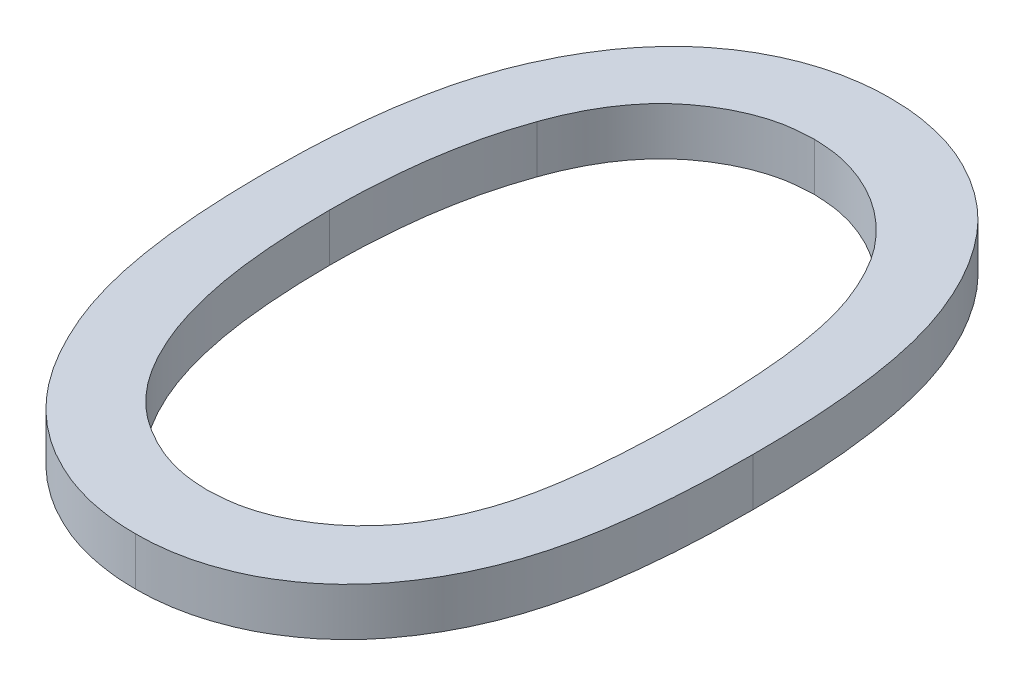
ISO-10303-21;
HEADER;
FILE_DESCRIPTION(('STEP AP214'),'2;1');
FILE_NAME('part.step','',(''),(''),'','','');
FILE_SCHEMA(('AUTOMOTIVE_DESIGN { 1 0 10303 214 1 1 1 1 }'));
ENDSEC;
DATA;
#1=APPLICATION_CONTEXT('core data for automotive mechanical design processes');
#2=APPLICATION_PROTOCOL_DEFINITION('international standard','automotive_design',2000,#1);
#3=PRODUCT_CONTEXT('',#1,'mechanical');
#4=PRODUCT('Part','Part','',(#3));
#5=PRODUCT_RELATED_PRODUCT_CATEGORY('part','',(#4));
#6=PRODUCT_DEFINITION_FORMATION('','',#4);
#7=PRODUCT_DEFINITION_CONTEXT('part definition',#1,'design');
#8=PRODUCT_DEFINITION('design','',#6,#7);
#9=PRODUCT_DEFINITION_SHAPE('','',#8);
#10=(LENGTH_UNIT() NAMED_UNIT(*) SI_UNIT(.MILLI.,.METRE.));
#11=(NAMED_UNIT(*) PLANE_ANGLE_UNIT() SI_UNIT($,.RADIAN.));
#12=(NAMED_UNIT(*) SI_UNIT($,.STERADIAN.) SOLID_ANGLE_UNIT());
#13=UNCERTAINTY_MEASURE_WITH_UNIT(LENGTH_MEASURE(1.E-05),#10,'distance_accuracy_value','');
#14=(GEOMETRIC_REPRESENTATION_CONTEXT(3) GLOBAL_UNCERTAINTY_ASSIGNED_CONTEXT((#13)) GLOBAL_UNIT_ASSIGNED_CONTEXT((#10,
#11,#12)) REPRESENTATION_CONTEXT('',''));
#15=CARTESIAN_POINT('',(0.,0.,0.));
#16=DIRECTION('',(0.,0.,1.));
#17=DIRECTION('',(1.,0.,0.));
#18=AXIS2_PLACEMENT_3D('',#15,#16,#17);
#19=CARTESIAN_POINT('',(-17.1346153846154,19.2,15.25));
#20=CARTESIAN_POINT('',(-17.1346153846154,19.,15.25));
#21=CARTESIAN_POINT('',(-17.1342383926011,19.2,15.2860629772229));
#22=CARTESIAN_POINT('',(-17.1342383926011,19.,15.2860629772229));
#23=CARTESIAN_POINT('',(-17.1335008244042,19.2,15.3566185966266));
#24=CARTESIAN_POINT('',(-17.1335008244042,19.,15.3566185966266));
#25=CARTESIAN_POINT('',(-17.1286549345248,19.2,15.4598415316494));
#26=CARTESIAN_POINT('',(-17.1286549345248,19.,15.4598415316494));
#27=CARTESIAN_POINT('',(-17.1208679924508,19.2,15.5580523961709));
#28=CARTESIAN_POINT('',(-17.1208679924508,19.,15.5580523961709));
#29=CARTESIAN_POINT('',(-17.1103285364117,19.2,15.6513402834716));
#30=CARTESIAN_POINT('',(-17.1103285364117,19.,15.6513402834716));
#31=CARTESIAN_POINT('',(-17.0958600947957,19.2,15.7395391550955));
#32=CARTESIAN_POINT('',(-17.0958600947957,19.,15.7395391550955));
#33=CARTESIAN_POINT('',(-17.078484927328,19.2,15.8227752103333));
#34=CARTESIAN_POINT('',(-17.078484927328,19.,15.8227752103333));
#35=CARTESIAN_POINT('',(-17.0581145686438,19.2,15.9010260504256));
#36=CARTESIAN_POINT('',(-17.0581145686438,19.,15.9010260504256));
#37=CARTESIAN_POINT('',(-17.034749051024,19.2,15.9744933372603));
#38=CARTESIAN_POINT('',(-17.034749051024,19.,15.9744933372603));
#39=CARTESIAN_POINT('',(-17.0084168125,19.2,16.0429134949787));
#40=CARTESIAN_POINT('',(-17.0084168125,19.,16.0429134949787));
#41=CARTESIAN_POINT('',(-16.9793262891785,19.2,16.1064338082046));
#42=CARTESIAN_POINT('',(-16.9793262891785,19.,16.1064338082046));
#43=CARTESIAN_POINT('',(-16.9482872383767,19.2,16.1653968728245));
#44=CARTESIAN_POINT('',(-16.9482872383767,19.,16.1653968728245));
#45=CARTESIAN_POINT('',(-16.9145521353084,19.2,16.2196130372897));
#46=CARTESIAN_POINT('',(-16.9145521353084,19.,16.2196130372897));
#47=CARTESIAN_POINT('',(-16.8785982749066,19.2,16.2693986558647));
#48=CARTESIAN_POINT('',(-16.8785982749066,19.,16.2693986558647));
#49=CARTESIAN_POINT('',(-16.8391346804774,19.2,16.3136076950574));
#50=CARTESIAN_POINT('',(-16.8391346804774,19.,16.3136076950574));
#51=CARTESIAN_POINT('',(-16.7986680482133,19.2,16.3543908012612));
#52=CARTESIAN_POINT('',(-16.7986680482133,19.,16.3543908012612));
#53=CARTESIAN_POINT('',(-16.7411159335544,19.2,16.4001116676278));
#54=CARTESIAN_POINT('',(-16.7411159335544,19.,16.4001116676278));
#55=CARTESIAN_POINT('',(-16.6663827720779,19.2,16.4470974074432));
#56=CARTESIAN_POINT('',(-16.6663827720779,19.,16.4470974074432));
#57=CARTESIAN_POINT('',(-16.5727480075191,19.2,16.4891603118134));
#58=CARTESIAN_POINT('',(-16.5727480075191,19.,16.4891603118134));
#59=CARTESIAN_POINT('',(-16.4758400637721,19.2,16.5140542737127));
#60=CARTESIAN_POINT('',(-16.4758400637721,19.,16.5140542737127));
#61=CARTESIAN_POINT('',(-16.4101922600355,19.2,16.5175065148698));
#62=CARTESIAN_POINT('',(-16.4101922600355,19.,16.5175065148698));
#63=CARTESIAN_POINT('',(-16.3774038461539,19.2,16.5192307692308));
#64=CARTESIAN_POINT('',(-16.3774038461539,19.,16.5192307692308));
#65=(BOUNDED_SURFACE() B_SPLINE_SURFACE(3,1,((#19,#20),(#21,#22),(#23,#24),(#25,#26),(#27,#28),
(#29,#30),(#31,#32),(#33,#34),(#35,#36),(#37,#38),(#39,#40),(#41,#42),(#43,#44),(#45,#46),(#47,
#48),(#49,#50),(#51,#52),(#53,#54),(#55,#56),(#57,#58),(#59,#60),(#61,#62),(#63,#64)),
.UNSPECIFIED.,.F.,.F.,.F.) B_SPLINE_SURFACE_WITH_KNOTS((4,1,1,1,1,1,1,1,1,1,1,1,1,1,1,1,1,1,1,1,
4),(2,2),(0.,0.0656764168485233,0.128493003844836,0.188147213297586,0.245074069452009,
0.299412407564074,0.350856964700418,0.399878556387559,0.446605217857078,0.491184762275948,
0.533303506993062,0.573776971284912,0.612447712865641,0.649515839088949,0.685448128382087,
0.720274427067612,0.754003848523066,0.819086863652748,0.880502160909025,0.94031567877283,1.),
(0.,1.),.UNSPECIFIED.) GEOMETRIC_REPRESENTATION_ITEM() RATIONAL_B_SPLINE_SURFACE(((1.,1.),(1.,
1.),(1.,1.),(1.,1.),(1.,1.),(1.,1.),(1.,1.),(1.,1.),(1.,1.),(1.,1.),(1.,1.),(1.,1.),(1.,1.),(1.,
1.),(1.,1.),(1.,1.),(1.,1.),(1.,1.),(1.,1.),(1.,1.),(1.,1.),(1.,1.),(1.,1.))) REPRESENTATION_ITEM('') SURFACE());
#66=CARTESIAN_POINT('',(-17.1346153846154,19.,15.25));
#67=CARTESIAN_POINT('',(-17.1342383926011,19.,15.2860629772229));
#68=CARTESIAN_POINT('',(-17.1335008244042,19.,15.3566185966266));
#69=CARTESIAN_POINT('',(-17.1286549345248,19.,15.4598415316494));
#70=CARTESIAN_POINT('',(-17.1208679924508,19.,15.5580523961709));
#71=CARTESIAN_POINT('',(-17.1103285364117,19.,15.6513402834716));
#72=CARTESIAN_POINT('',(-17.0958600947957,19.,15.7395391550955));
#73=CARTESIAN_POINT('',(-17.078484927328,19.,15.8227752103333));
#74=CARTESIAN_POINT('',(-17.0581145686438,19.,15.9010260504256));
#75=CARTESIAN_POINT('',(-17.034749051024,19.,15.9744933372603));
#76=CARTESIAN_POINT('',(-17.0084168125,19.,16.0429134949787));
#77=CARTESIAN_POINT('',(-16.9793262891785,19.,16.1064338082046));
#78=CARTESIAN_POINT('',(-16.9482872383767,19.,16.1653968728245));
#79=CARTESIAN_POINT('',(-16.9145521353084,19.,16.2196130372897));
#80=CARTESIAN_POINT('',(-16.8785982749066,19.,16.2693986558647));
#81=CARTESIAN_POINT('',(-16.8391346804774,19.,16.3136076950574));
#82=CARTESIAN_POINT('',(-16.7986680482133,19.,16.3543908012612));
#83=CARTESIAN_POINT('',(-16.7411159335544,19.,16.4001116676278));
#84=CARTESIAN_POINT('',(-16.6663827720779,19.,16.4470974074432));
#85=CARTESIAN_POINT('',(-16.5727480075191,19.,16.4891603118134));
#86=CARTESIAN_POINT('',(-16.4758400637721,19.,16.5140542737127));
#87=CARTESIAN_POINT('',(-16.4101922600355,19.,16.5175065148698));
#88=CARTESIAN_POINT('',(-16.3774038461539,19.,16.5192307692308));
#89=(BOUNDED_CURVE() B_SPLINE_CURVE(3,(#66,#67,#68,#69,#70,#71,#72,#73,#74,#75,#76,#77,#78,#79,
#80,#81,#82,#83,#84,#85,#86,#87,#88),.UNSPECIFIED.,.F.,.F.) B_SPLINE_CURVE_WITH_KNOTS((4,1,1,1,
1,1,1,1,1,1,1,1,1,1,1,1,1,1,1,1,4),(0.,0.0656764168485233,0.128493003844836,0.188147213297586,
0.245074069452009,0.299412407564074,0.350856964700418,0.399878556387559,0.446605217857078,
0.491184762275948,0.533303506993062,0.573776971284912,0.612447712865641,0.649515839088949,
0.685448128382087,0.720274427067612,0.754003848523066,0.819086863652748,0.880502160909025,
0.94031567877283,1.),
.UNSPECIFIED.) CURVE() GEOMETRIC_REPRESENTATION_ITEM() RATIONAL_B_SPLINE_CURVE((1.,1.,1.,1.,1.,
1.,1.,1.,1.,1.,1.,1.,1.,1.,1.,1.,1.,1.,1.,1.,1.,1.,1.)) REPRESENTATION_ITEM(''));
#90=CARTESIAN_POINT('',(-17.1346153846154,19.,15.25));
#91=VERTEX_POINT('',#90);
#92=CARTESIAN_POINT('',(-16.3774038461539,19.,16.5192307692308));
#93=VERTEX_POINT('',#92);
#94=EDGE_CURVE('E271',#91,#93,#89,.T.);
#95=DIRECTION('',(0.,-1.,0.));
#96=VECTOR('',#95,1.);
#97=CARTESIAN_POINT('',(-17.1346153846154,19.2,15.25));
#98=LINE('',#97,#96);
#99=CARTESIAN_POINT('',(-17.1346153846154,19.2,15.25));
#100=VERTEX_POINT('',#99);
#101=EDGE_CURVE('E11',#100,#91,#98,.T.);
#102=CARTESIAN_POINT('',(-17.1346153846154,19.2,15.25));
#103=CARTESIAN_POINT('',(-17.1342383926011,19.2,15.2860629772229));
#104=CARTESIAN_POINT('',(-17.1335008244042,19.2,15.3566185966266));
#105=CARTESIAN_POINT('',(-17.1286549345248,19.2,15.4598415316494));
#106=CARTESIAN_POINT('',(-17.1208679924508,19.2,15.5580523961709));
#107=CARTESIAN_POINT('',(-17.1103285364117,19.2,15.6513402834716));
#108=CARTESIAN_POINT('',(-17.0958600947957,19.2,15.7395391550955));
#109=CARTESIAN_POINT('',(-17.078484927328,19.2,15.8227752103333));
#110=CARTESIAN_POINT('',(-17.0581145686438,19.2,15.9010260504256));
#111=CARTESIAN_POINT('',(-17.034749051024,19.2,15.9744933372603));
#112=CARTESIAN_POINT('',(-17.0084168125,19.2,16.0429134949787));
#113=CARTESIAN_POINT('',(-16.9793262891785,19.2,16.1064338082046));
#114=CARTESIAN_POINT('',(-16.9482872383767,19.2,16.1653968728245));
#115=CARTESIAN_POINT('',(-16.9145521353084,19.2,16.2196130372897));
#116=CARTESIAN_POINT('',(-16.8785982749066,19.2,16.2693986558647));
#117=CARTESIAN_POINT('',(-16.8391346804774,19.2,16.3136076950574));
#118=CARTESIAN_POINT('',(-16.7986680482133,19.2,16.3543908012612));
#119=CARTESIAN_POINT('',(-16.7411159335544,19.2,16.4001116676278));
#120=CARTESIAN_POINT('',(-16.6663827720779,19.2,16.4470974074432));
#121=CARTESIAN_POINT('',(-16.5727480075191,19.2,16.4891603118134));
#122=CARTESIAN_POINT('',(-16.4758400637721,19.2,16.5140542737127));
#123=CARTESIAN_POINT('',(-16.4101922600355,19.2,16.5175065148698));
#124=CARTESIAN_POINT('',(-16.3774038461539,19.2,16.5192307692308));
#125=(BOUNDED_CURVE() B_SPLINE_CURVE(3,(#102,#103,#104,#105,#106,#107,#108,#109,#110,#111,#112,
#113,#114,#115,#116,#117,#118,#119,#120,#121,#122,#123,#124),.UNSPECIFIED.,.F.,
.F.) B_SPLINE_CURVE_WITH_KNOTS((4,1,1,1,1,1,1,1,1,1,1,1,1,1,1,1,1,1,1,1,4),(0.,
0.0656764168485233,0.128493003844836,0.188147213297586,0.245074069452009,0.299412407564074,
0.350856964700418,0.399878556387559,0.446605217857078,0.491184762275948,0.533303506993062,
0.573776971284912,0.612447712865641,0.649515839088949,0.685448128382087,0.720274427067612,
0.754003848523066,0.819086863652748,0.880502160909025,0.94031567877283,1.),
.UNSPECIFIED.) CURVE() GEOMETRIC_REPRESENTATION_ITEM() RATIONAL_B_SPLINE_CURVE((1.,1.,1.,1.,1.,
1.,1.,1.,1.,1.,1.,1.,1.,1.,1.,1.,1.,1.,1.,1.,1.,1.,1.)) REPRESENTATION_ITEM(''));
#126=CARTESIAN_POINT('',(-16.3774038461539,19.2,16.5192307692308));
#127=VERTEX_POINT('',#126);
#128=EDGE_CURVE('E213',#100,#127,#125,.T.);
#129=DIRECTION('',(0.,-1.,0.));
#130=VECTOR('',#129,1.);
#131=CARTESIAN_POINT('',(-16.3774038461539,19.2,16.5192307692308));
#132=LINE('',#131,#130);
#133=EDGE_CURVE('E289',#127,#93,#132,.T.);
#134=ORIENTED_EDGE('',*,*,#94,.F.);
#135=ORIENTED_EDGE('',*,*,#101,.F.);
#136=ORIENTED_EDGE('',*,*,#128,.T.);
#137=ORIENTED_EDGE('',*,*,#133,.T.);
#138=EDGE_LOOP('',(#134,#135,#136,#137));
#139=FACE_BOUND('',#138,.T.);
#140=ADVANCED_FACE('F16',(#139),#65,.T.);
#141=CARTESIAN_POINT('',(-17.0210336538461,19.2,14.4957932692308));
#142=CARTESIAN_POINT('',(-17.0210336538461,19.,14.4957932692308));
#143=CARTESIAN_POINT('',(-17.0300780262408,19.2,14.5225616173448));
#144=CARTESIAN_POINT('',(-17.0300780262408,19.,14.5225616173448));
#145=CARTESIAN_POINT('',(-17.0484419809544,19.2,14.5769128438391));
#146=CARTESIAN_POINT('',(-17.0484419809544,19.,14.5769128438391));
#147=CARTESIAN_POINT('',(-17.0721092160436,19.2,14.6612245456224));
#148=CARTESIAN_POINT('',(-17.0721092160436,19.,14.6612245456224));
#149=CARTESIAN_POINT('',(-17.0907481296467,19.2,14.7496840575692));
#150=CARTESIAN_POINT('',(-17.0907481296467,19.,14.7496840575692));
#151=CARTESIAN_POINT('',(-17.1075167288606,19.2,14.8417627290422));
#152=CARTESIAN_POINT('',(-17.1075167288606,19.,14.8417627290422));
#153=CARTESIAN_POINT('',(-17.118962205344,19.2,14.938139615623));
#154=CARTESIAN_POINT('',(-17.118962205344,19.,14.938139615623));
#155=CARTESIAN_POINT('',(-17.1281746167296,19.2,15.0385165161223));
#156=CARTESIAN_POINT('',(-17.1281746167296,19.,15.0385165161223));
#157=CARTESIAN_POINT('',(-17.1336009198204,19.2,15.142969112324));
#158=CARTESIAN_POINT('',(-17.1336009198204,19.,15.142969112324));
#159=CARTESIAN_POINT('',(-17.1342735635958,19.2,15.2139362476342));
#160=CARTESIAN_POINT('',(-17.1342735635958,19.,15.2139362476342));
#161=CARTESIAN_POINT('',(-17.1346153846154,19.2,15.25));
#162=CARTESIAN_POINT('',(-17.1346153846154,19.,15.25));
#163=(BOUNDED_SURFACE() B_SPLINE_SURFACE(3,1,((#141,#142),(#143,#144),(#145,#146),(#147,#148),
(#149,#150),(#151,#152),(#153,#154),(#155,#156),(#157,#158),(#159,#160),(#161,#162)),
.UNSPECIFIED.,.F.,.F.,.F.) B_SPLINE_SURFACE_WITH_KNOTS((4,1,1,1,1,1,1,1,4),(2,2),(0.,
0.110588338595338,0.224541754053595,0.342503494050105,0.46432409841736,0.590756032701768,
0.722227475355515,0.858842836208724,1.),(0.,1.),
.UNSPECIFIED.) GEOMETRIC_REPRESENTATION_ITEM() RATIONAL_B_SPLINE_SURFACE(((1.,1.),(1.,1.),(1.,
1.),(1.,1.),(1.,1.),(1.,1.),(1.,1.),(1.,1.),(1.,1.),(1.,1.),(1.,1.))) REPRESENTATION_ITEM('') SURFACE());
#164=CARTESIAN_POINT('',(-17.0210336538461,19.,14.4957932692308));
#165=CARTESIAN_POINT('',(-17.0300780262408,19.,14.5225616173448));
#166=CARTESIAN_POINT('',(-17.0484419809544,19.,14.5769128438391));
#167=CARTESIAN_POINT('',(-17.0721092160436,19.,14.6612245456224));
#168=CARTESIAN_POINT('',(-17.0907481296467,19.,14.7496840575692));
#169=CARTESIAN_POINT('',(-17.1075167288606,19.,14.8417627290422));
#170=CARTESIAN_POINT('',(-17.118962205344,19.,14.938139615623));
#171=CARTESIAN_POINT('',(-17.1281746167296,19.,15.0385165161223));
#172=CARTESIAN_POINT('',(-17.1336009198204,19.,15.142969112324));
#173=CARTESIAN_POINT('',(-17.1342735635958,19.,15.2139362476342));
#174=CARTESIAN_POINT('',(-17.1346153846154,19.,15.25));
#175=(BOUNDED_CURVE() B_SPLINE_CURVE(3,(#164,#165,#166,#167,#168,#169,#170,#171,#172,#173,#174),
.UNSPECIFIED.,.F.,.F.) B_SPLINE_CURVE_WITH_KNOTS((4,1,1,1,1,1,1,1,4),(0.,0.110588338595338,
0.224541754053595,0.342503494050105,0.46432409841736,0.590756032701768,0.722227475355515,
0.858842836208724,1.),
.UNSPECIFIED.) CURVE() GEOMETRIC_REPRESENTATION_ITEM() RATIONAL_B_SPLINE_CURVE((1.,1.,1.,1.,1.,
1.,1.,1.,1.,1.,1.)) REPRESENTATION_ITEM(''));
#176=CARTESIAN_POINT('',(-17.0210336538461,19.,14.4957932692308));
#177=VERTEX_POINT('',#176);
#178=EDGE_CURVE('E195',#177,#91,#175,.T.);
#179=DIRECTION('',(0.,-1.,0.));
#180=VECTOR('',#179,1.);
#181=CARTESIAN_POINT('',(-17.0210336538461,19.2,14.4957932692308));
#182=LINE('',#181,#180);
#183=CARTESIAN_POINT('',(-17.0210336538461,19.2,14.4957932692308));
#184=VERTEX_POINT('',#183);
#185=EDGE_CURVE('E26',#184,#177,#182,.T.);
#186=CARTESIAN_POINT('',(-17.0210336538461,19.2,14.4957932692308));
#187=CARTESIAN_POINT('',(-17.0300780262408,19.2,14.5225616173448));
#188=CARTESIAN_POINT('',(-17.0484419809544,19.2,14.5769128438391));
#189=CARTESIAN_POINT('',(-17.0721092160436,19.2,14.6612245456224));
#190=CARTESIAN_POINT('',(-17.0907481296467,19.2,14.7496840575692));
#191=CARTESIAN_POINT('',(-17.1075167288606,19.2,14.8417627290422));
#192=CARTESIAN_POINT('',(-17.118962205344,19.2,14.938139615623));
#193=CARTESIAN_POINT('',(-17.1281746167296,19.2,15.0385165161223));
#194=CARTESIAN_POINT('',(-17.1336009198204,19.2,15.142969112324));
#195=CARTESIAN_POINT('',(-17.1342735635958,19.2,15.2139362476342));
#196=CARTESIAN_POINT('',(-17.1346153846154,19.2,15.25));
#197=(BOUNDED_CURVE() B_SPLINE_CURVE(3,(#186,#187,#188,#189,#190,#191,#192,#193,#194,#195,#196),
.UNSPECIFIED.,.F.,.F.) B_SPLINE_CURVE_WITH_KNOTS((4,1,1,1,1,1,1,1,4),(0.,0.110588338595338,
0.224541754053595,0.342503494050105,0.46432409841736,0.590756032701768,0.722227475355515,
0.858842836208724,1.),
.UNSPECIFIED.) CURVE() GEOMETRIC_REPRESENTATION_ITEM() RATIONAL_B_SPLINE_CURVE((1.,1.,1.,1.,1.,
1.,1.,1.,1.,1.,1.)) REPRESENTATION_ITEM(''));
#198=EDGE_CURVE('E222',#184,#100,#197,.T.);
#199=ORIENTED_EDGE('',*,*,#178,.F.);
#200=ORIENTED_EDGE('',*,*,#185,.F.);
#201=ORIENTED_EDGE('',*,*,#198,.T.);
#202=ORIENTED_EDGE('',*,*,#101,.T.);
#203=EDGE_LOOP('',(#199,#200,#201,#202));
#204=FACE_BOUND('',#203,.T.);
#205=ADVANCED_FACE('F373',(#204),#163,.T.);
#206=CARTESIAN_POINT('',(-16.3774038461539,19.2,13.9807692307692));
#207=CARTESIAN_POINT('',(-16.3774038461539,19.,13.9807692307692));
#208=CARTESIAN_POINT('',(-16.4106022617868,19.2,13.9822166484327));
#209=CARTESIAN_POINT('',(-16.4106022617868,19.,13.9822166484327));
#210=CARTESIAN_POINT('',(-16.4768813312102,19.2,13.9851063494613));
#211=CARTESIAN_POINT('',(-16.4768813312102,19.,13.9851063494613));
#212=CARTESIAN_POINT('',(-16.5742220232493,19.2,14.0103265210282));
#213=CARTESIAN_POINT('',(-16.5742220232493,19.,14.0103265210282));
#214=CARTESIAN_POINT('',(-16.6679390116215,19.2,14.051326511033));
#215=CARTESIAN_POINT('',(-16.6679390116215,19.,14.051326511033));
#216=CARTESIAN_POINT('',(-16.7418994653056,19.2,14.0981680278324));
#217=CARTESIAN_POINT('',(-16.7418994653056,19.,14.0981680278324));
#218=CARTESIAN_POINT('',(-16.7980111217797,19.2,14.1430623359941));
#219=CARTESIAN_POINT('',(-16.7980111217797,19.,14.1430623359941));
#220=CARTESIAN_POINT('',(-16.8382290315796,19.2,14.1812949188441));
#221=CARTESIAN_POINT('',(-16.8382290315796,19.,14.1812949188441));
#222=CARTESIAN_POINT('',(-16.8751384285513,19.2,14.2241166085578));
#223=CARTESIAN_POINT('',(-16.8751384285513,19.,14.2241166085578));
#224=CARTESIAN_POINT('',(-16.9101461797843,19.2,14.270315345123));
#225=CARTESIAN_POINT('',(-16.9101461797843,19.,14.270315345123));
#226=CARTESIAN_POINT('',(-16.9422538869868,19.2,14.3207776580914));
#227=CARTESIAN_POINT('',(-16.9422538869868,19.,14.3207776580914));
#228=CARTESIAN_POINT('',(-16.9714508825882,19.2,14.3752598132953));
#229=CARTESIAN_POINT('',(-16.9714508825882,19.,14.3752598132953));
#230=CARTESIAN_POINT('',(-16.9980937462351,19.2,14.4339134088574));
#231=CARTESIAN_POINT('',(-16.9980937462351,19.,14.4339134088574));
#232=CARTESIAN_POINT('',(-17.0132729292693,19.2,14.4748588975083));
#233=CARTESIAN_POINT('',(-17.0132729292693,19.,14.4748588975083));
#234=CARTESIAN_POINT('',(-17.0210336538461,19.2,14.4957932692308));
#235=CARTESIAN_POINT('',(-17.0210336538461,19.,14.4957932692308));
#236=(BOUNDED_SURFACE() B_SPLINE_SURFACE(3,1,((#206,#207),(#208,#209),(#210,#211),(#212,#213),
(#214,#215),(#216,#217),(#218,#219),(#220,#221),(#222,#223),(#224,#225),(#226,#227),(#228,#229),
(#230,#231),(#232,#233),(#234,#235)),.UNSPECIFIED.,.F.,.F.,.F.) B_SPLINE_SURFACE_WITH_KNOTS((4,
1,1,1,1,1,1,1,1,1,1,1,4),(2,2),(0.,0.11280178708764,0.225203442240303,0.33966280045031,
0.459731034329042,0.521784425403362,0.583968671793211,0.648210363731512,0.713910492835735,
0.781026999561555,0.851466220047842,0.92405851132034,1.),(0.,1.),
.UNSPECIFIED.) GEOMETRIC_REPRESENTATION_ITEM() RATIONAL_B_SPLINE_SURFACE(((1.,1.),(1.,1.),(1.,
1.),(1.,1.),(1.,1.),(1.,1.),(1.,1.),(1.,1.),(1.,1.),(1.,1.),(1.,1.),(1.,1.),(1.,1.),(1.,1.),(1.,1.))) REPRESENTATION_ITEM('') SURFACE());
#237=CARTESIAN_POINT('',(-16.3774038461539,19.,13.9807692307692));
#238=CARTESIAN_POINT('',(-16.4106022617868,19.,13.9822166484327));
#239=CARTESIAN_POINT('',(-16.4768813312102,19.,13.9851063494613));
#240=CARTESIAN_POINT('',(-16.5742220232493,19.,14.0103265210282));
#241=CARTESIAN_POINT('',(-16.6679390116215,19.,14.051326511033));
#242=CARTESIAN_POINT('',(-16.7418994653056,19.,14.0981680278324));
#243=CARTESIAN_POINT('',(-16.7980111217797,19.,14.1430623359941));
#244=CARTESIAN_POINT('',(-16.8382290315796,19.,14.1812949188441));
#245=CARTESIAN_POINT('',(-16.8751384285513,19.,14.2241166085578));
#246=CARTESIAN_POINT('',(-16.9101461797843,19.,14.270315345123));
#247=CARTESIAN_POINT('',(-16.9422538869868,19.,14.3207776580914));
#248=CARTESIAN_POINT('',(-16.9714508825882,19.,14.3752598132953));
#249=CARTESIAN_POINT('',(-16.9980937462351,19.,14.4339134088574));
#250=CARTESIAN_POINT('',(-17.0132729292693,19.,14.4748588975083));
#251=CARTESIAN_POINT('',(-17.0210336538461,19.,14.4957932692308));
#252=(BOUNDED_CURVE() B_SPLINE_CURVE(3,(#237,#238,#239,#240,#241,#242,#243,#244,#245,#246,#247,
#248,#249,#250,#251),.UNSPECIFIED.,.F.,.F.) B_SPLINE_CURVE_WITH_KNOTS((4,1,1,1,1,1,1,1,1,1,1,1,
4),(0.,0.11280178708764,0.225203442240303,0.33966280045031,0.459731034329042,0.521784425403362,
0.583968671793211,0.648210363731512,0.713910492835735,0.781026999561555,0.851466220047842,
0.92405851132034,1.),
.UNSPECIFIED.) CURVE() GEOMETRIC_REPRESENTATION_ITEM() RATIONAL_B_SPLINE_CURVE((1.,1.,1.,1.,1.,
1.,1.,1.,1.,1.,1.,1.,1.,1.,1.)) REPRESENTATION_ITEM(''));
#253=CARTESIAN_POINT('',(-16.3774038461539,19.,13.9807692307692));
#254=VERTEX_POINT('',#253);
#255=EDGE_CURVE('E177',#254,#177,#252,.T.);
#256=DIRECTION('',(0.,-1.,0.));
#257=VECTOR('',#256,1.);
#258=CARTESIAN_POINT('',(-16.3774038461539,19.2,13.9807692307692));
#259=LINE('',#258,#257);
#260=CARTESIAN_POINT('',(-16.3774038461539,19.2,13.9807692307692));
#261=VERTEX_POINT('',#260);
#262=EDGE_CURVE('E295',#261,#254,#259,.T.);
#263=CARTESIAN_POINT('',(-16.3774038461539,19.2,13.9807692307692));
#264=CARTESIAN_POINT('',(-16.4106022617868,19.2,13.9822166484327));
#265=CARTESIAN_POINT('',(-16.4768813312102,19.2,13.9851063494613));
#266=CARTESIAN_POINT('',(-16.5742220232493,19.2,14.0103265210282));
#267=CARTESIAN_POINT('',(-16.6679390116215,19.2,14.051326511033));
#268=CARTESIAN_POINT('',(-16.7418994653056,19.2,14.0981680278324));
#269=CARTESIAN_POINT('',(-16.7980111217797,19.2,14.1430623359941));
#270=CARTESIAN_POINT('',(-16.8382290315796,19.2,14.1812949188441));
#271=CARTESIAN_POINT('',(-16.8751384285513,19.2,14.2241166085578));
#272=CARTESIAN_POINT('',(-16.9101461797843,19.2,14.270315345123));
#273=CARTESIAN_POINT('',(-16.9422538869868,19.2,14.3207776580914));
#274=CARTESIAN_POINT('',(-16.9714508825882,19.2,14.3752598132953));
#275=CARTESIAN_POINT('',(-16.9980937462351,19.2,14.4339134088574));
#276=CARTESIAN_POINT('',(-17.0132729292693,19.2,14.4748588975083));
#277=CARTESIAN_POINT('',(-17.0210336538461,19.2,14.4957932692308));
#278=(BOUNDED_CURVE() B_SPLINE_CURVE(3,(#263,#264,#265,#266,#267,#268,#269,#270,#271,#272,#273,
#274,#275,#276,#277),.UNSPECIFIED.,.F.,.F.) B_SPLINE_CURVE_WITH_KNOTS((4,1,1,1,1,1,1,1,1,1,1,1,
4),(0.,0.11280178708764,0.225203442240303,0.33966280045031,0.459731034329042,0.521784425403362,
0.583968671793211,0.648210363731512,0.713910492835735,0.781026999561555,0.851466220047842,
0.92405851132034,1.),
.UNSPECIFIED.) CURVE() GEOMETRIC_REPRESENTATION_ITEM() RATIONAL_B_SPLINE_CURVE((1.,1.,1.,1.,1.,
1.,1.,1.,1.,1.,1.,1.,1.,1.,1.)) REPRESENTATION_ITEM(''));
#279=EDGE_CURVE('E230',#261,#184,#278,.T.);
#280=ORIENTED_EDGE('',*,*,#255,.F.);
#281=ORIENTED_EDGE('',*,*,#262,.F.);
#282=ORIENTED_EDGE('',*,*,#279,.T.);
#283=ORIENTED_EDGE('',*,*,#185,.T.);
#284=EDGE_LOOP('',(#280,#281,#282,#283));
#285=FACE_BOUND('',#284,.T.);
#286=ADVANCED_FACE('F364',(#285),#236,.T.);
#287=CARTESIAN_POINT('',(-15.6346153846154,19.2,15.25));
#288=CARTESIAN_POINT('',(-15.6346153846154,19.,15.25));
#289=CARTESIAN_POINT('',(-15.6347200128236,19.2,15.2099298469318));
#290=CARTESIAN_POINT('',(-15.6347200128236,19.,15.2099298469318));
#291=CARTESIAN_POINT('',(-15.634923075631,19.2,15.1321615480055));
#292=CARTESIAN_POINT('',(-15.634923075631,19.,15.1321615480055));
#293=CARTESIAN_POINT('',(-15.6400744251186,19.2,15.0193505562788));
#294=CARTESIAN_POINT('',(-15.6400744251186,19.,15.0193505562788));
#295=CARTESIAN_POINT('',(-15.6472445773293,19.2,14.9139549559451));
#296=CARTESIAN_POINT('',(-15.6472445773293,19.,14.9139549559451));
#297=CARTESIAN_POINT('',(-15.6562650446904,19.2,14.8160158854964));
#298=CARTESIAN_POINT('',(-15.6562650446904,19.,14.8160158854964));
#299=CARTESIAN_POINT('',(-15.6697744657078,19.2,14.7258756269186));
#300=CARTESIAN_POINT('',(-15.6697744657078,19.,14.7258756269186));
#301=CARTESIAN_POINT('',(-15.6851017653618,19.2,14.6431594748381));
#302=CARTESIAN_POINT('',(-15.6851017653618,19.,14.6431594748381));
#303=CARTESIAN_POINT('',(-15.7034858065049,19.2,14.568020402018));
#304=CARTESIAN_POINT('',(-15.7034858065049,19.,14.568020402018));
#305=CARTESIAN_POINT('',(-15.7253450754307,19.2,14.4998022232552));
#306=CARTESIAN_POINT('',(-15.7253450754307,19.,14.4998022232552));
#307=CARTESIAN_POINT('',(-15.7502435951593,19.2,14.4375374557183));
#308=CARTESIAN_POINT('',(-15.7502435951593,19.,14.4375374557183));
#309=CARTESIAN_POINT('',(-15.7773851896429,19.2,14.3795716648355));
#310=CARTESIAN_POINT('',(-15.7773851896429,19.,14.3795716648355));
#311=CARTESIAN_POINT('',(-15.8067854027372,19.2,14.3251997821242));
#312=CARTESIAN_POINT('',(-15.8067854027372,19.,14.3251997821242));
#313=CARTESIAN_POINT('',(-15.8391187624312,19.2,14.2746179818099));
#314=CARTESIAN_POINT('',(-15.8391187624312,19.,14.2746179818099));
#315=CARTESIAN_POINT('',(-15.8748485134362,19.2,14.2281087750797));
#316=CARTESIAN_POINT('',(-15.8748485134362,19.,14.2281087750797));
#317=CARTESIAN_POINT('',(-15.9131771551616,19.2,14.1854512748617));
#318=CARTESIAN_POINT('',(-15.9131771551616,19.,14.1854512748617));
#319=CARTESIAN_POINT('',(-15.954327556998,19.2,14.146819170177));
#320=CARTESIAN_POINT('',(-15.954327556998,19.,14.146819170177));
#321=CARTESIAN_POINT('',(-16.0112796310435,19.2,14.1009706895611));
#322=CARTESIAN_POINT('',(-16.0112796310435,19.,14.1009706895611));
#323=CARTESIAN_POINT('',(-16.0861012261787,19.2,14.0530344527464));
#324=CARTESIAN_POINT('',(-16.0861012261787,19.,14.0530344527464));
#325=CARTESIAN_POINT('',(-16.1808552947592,19.2,14.0118047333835));
#326=CARTESIAN_POINT('',(-16.1808552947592,19.,14.0118047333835));
#327=CARTESIAN_POINT('',(-16.2782622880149,19.2,13.9857270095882));
#328=CARTESIAN_POINT('',(-16.2782622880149,19.,13.9857270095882));
#329=CARTESIAN_POINT('',(-16.344394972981,19.2,13.9824199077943));
#330=CARTESIAN_POINT('',(-16.344394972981,19.,13.9824199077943));
#331=CARTESIAN_POINT('',(-16.3774038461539,19.2,13.9807692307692));
#332=CARTESIAN_POINT('',(-16.3774038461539,19.,13.9807692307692));
#333=(BOUNDED_SURFACE() B_SPLINE_SURFACE(3,1,((#287,#288),(#289,#290),(#291,#292),(#293,#294),
(#295,#296),(#297,#298),(#299,#300),(#301,#302),(#303,#304),(#305,#306),(#307,#308),(#309,#310),
(#311,#312),(#313,#314),(#315,#316),(#317,#318),(#319,#320),(#321,#322),(#323,#324),(#325,#326),
(#327,#328),(#329,#330),(#331,#332)),.UNSPECIFIED.,.F.,.F.,.F.) B_SPLINE_SURFACE_WITH_KNOTS((4,
1,1,1,1,1,1,1,1,1,1,1,1,1,1,1,1,1,1,1,4),(2,2),(0.,0.0729596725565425,0.141600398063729,
0.205586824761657,0.265331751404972,0.320634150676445,0.371501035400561,0.418479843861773,
0.461393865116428,0.501833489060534,0.54050878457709,0.577889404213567,0.614316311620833,
0.649701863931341,0.684570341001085,0.718633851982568,0.752359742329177,0.817630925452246,
0.879707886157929,0.939958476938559,1.),(0.,1.),
.UNSPECIFIED.) GEOMETRIC_REPRESENTATION_ITEM() RATIONAL_B_SPLINE_SURFACE(((1.,1.),(1.,1.),(1.,
1.),(1.,1.),(1.,1.),(1.,1.),(1.,1.),(1.,1.),(1.,1.),(1.,1.),(1.,1.),(1.,1.),(1.,1.),(1.,1.),(1.,
1.),(1.,1.),(1.,1.),(1.,1.),(1.,1.),(1.,1.),(1.,1.),(1.,1.),(1.,1.))) REPRESENTATION_ITEM('') SURFACE());
#334=CARTESIAN_POINT('',(-15.6346153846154,19.,15.25));
#335=CARTESIAN_POINT('',(-15.6347200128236,19.,15.2099298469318));
#336=CARTESIAN_POINT('',(-15.634923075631,19.,15.1321615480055));
#337=CARTESIAN_POINT('',(-15.6400744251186,19.,15.0193505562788));
#338=CARTESIAN_POINT('',(-15.6472445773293,19.,14.9139549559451));
#339=CARTESIAN_POINT('',(-15.6562650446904,19.,14.8160158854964));
#340=CARTESIAN_POINT('',(-15.6697744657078,19.,14.7258756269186));
#341=CARTESIAN_POINT('',(-15.6851017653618,19.,14.6431594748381));
#342=CARTESIAN_POINT('',(-15.7034858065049,19.,14.568020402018));
#343=CARTESIAN_POINT('',(-15.7253450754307,19.,14.4998022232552));
#344=CARTESIAN_POINT('',(-15.7502435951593,19.,14.4375374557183));
#345=CARTESIAN_POINT('',(-15.7773851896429,19.,14.3795716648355));
#346=CARTESIAN_POINT('',(-15.8067854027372,19.,14.3251997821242));
#347=CARTESIAN_POINT('',(-15.8391187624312,19.,14.2746179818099));
#348=CARTESIAN_POINT('',(-15.8748485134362,19.,14.2281087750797));
#349=CARTESIAN_POINT('',(-15.9131771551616,19.,14.1854512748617));
#350=CARTESIAN_POINT('',(-15.954327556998,19.,14.146819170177));
#351=CARTESIAN_POINT('',(-16.0112796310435,19.,14.1009706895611));
#352=CARTESIAN_POINT('',(-16.0861012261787,19.,14.0530344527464));
#353=CARTESIAN_POINT('',(-16.1808552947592,19.,14.0118047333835));
#354=CARTESIAN_POINT('',(-16.2782622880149,19.,13.9857270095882));
#355=CARTESIAN_POINT('',(-16.344394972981,19.,13.9824199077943));
#356=CARTESIAN_POINT('',(-16.3774038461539,19.,13.9807692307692));
#357=(BOUNDED_CURVE() B_SPLINE_CURVE(3,(#334,#335,#336,#337,#338,#339,#340,#341,#342,#343,#344,
#345,#346,#347,#348,#349,#350,#351,#352,#353,#354,#355,#356),.UNSPECIFIED.,.F.,
.F.) B_SPLINE_CURVE_WITH_KNOTS((4,1,1,1,1,1,1,1,1,1,1,1,1,1,1,1,1,1,1,1,4),(0.,
0.0729596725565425,0.141600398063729,0.205586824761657,0.265331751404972,0.320634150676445,
0.371501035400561,0.418479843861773,0.461393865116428,0.501833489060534,0.54050878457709,
0.577889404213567,0.614316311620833,0.649701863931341,0.684570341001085,0.718633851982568,
0.752359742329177,0.817630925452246,0.879707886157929,0.939958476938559,1.),
.UNSPECIFIED.) CURVE() GEOMETRIC_REPRESENTATION_ITEM() RATIONAL_B_SPLINE_CURVE((1.,1.,1.,1.,1.,
1.,1.,1.,1.,1.,1.,1.,1.,1.,1.,1.,1.,1.,1.,1.,1.,1.,1.)) REPRESENTATION_ITEM(''));
#358=CARTESIAN_POINT('',(-15.6346153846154,19.,15.25));
#359=VERTEX_POINT('',#358);
#360=EDGE_CURVE('E168',#359,#254,#357,.T.);
#361=DIRECTION('',(0.,-1.,0.));
#362=VECTOR('',#361,1.);
#363=CARTESIAN_POINT('',(-15.6346153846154,19.2,15.25));
#364=LINE('',#363,#362);
#365=CARTESIAN_POINT('',(-15.6346153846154,19.2,15.25));
#366=VERTEX_POINT('',#365);
#367=EDGE_CURVE('E292',#366,#359,#364,.T.);
#368=CARTESIAN_POINT('',(-15.6346153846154,19.2,15.25));
#369=CARTESIAN_POINT('',(-15.6347200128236,19.2,15.2099298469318));
#370=CARTESIAN_POINT('',(-15.634923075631,19.2,15.1321615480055));
#371=CARTESIAN_POINT('',(-15.6400744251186,19.2,15.0193505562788));
#372=CARTESIAN_POINT('',(-15.6472445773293,19.2,14.9139549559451));
#373=CARTESIAN_POINT('',(-15.6562650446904,19.2,14.8160158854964));
#374=CARTESIAN_POINT('',(-15.6697744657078,19.2,14.7258756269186));
#375=CARTESIAN_POINT('',(-15.6851017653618,19.2,14.6431594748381));
#376=CARTESIAN_POINT('',(-15.7034858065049,19.2,14.568020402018));
#377=CARTESIAN_POINT('',(-15.7253450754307,19.2,14.4998022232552));
#378=CARTESIAN_POINT('',(-15.7502435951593,19.2,14.4375374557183));
#379=CARTESIAN_POINT('',(-15.7773851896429,19.2,14.3795716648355));
#380=CARTESIAN_POINT('',(-15.8067854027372,19.2,14.3251997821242));
#381=CARTESIAN_POINT('',(-15.8391187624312,19.2,14.2746179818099));
#382=CARTESIAN_POINT('',(-15.8748485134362,19.2,14.2281087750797));
#383=CARTESIAN_POINT('',(-15.9131771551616,19.2,14.1854512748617));
#384=CARTESIAN_POINT('',(-15.954327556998,19.2,14.146819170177));
#385=CARTESIAN_POINT('',(-16.0112796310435,19.2,14.1009706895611));
#386=CARTESIAN_POINT('',(-16.0861012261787,19.2,14.0530344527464));
#387=CARTESIAN_POINT('',(-16.1808552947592,19.2,14.0118047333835));
#388=CARTESIAN_POINT('',(-16.2782622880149,19.2,13.9857270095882));
#389=CARTESIAN_POINT('',(-16.344394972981,19.2,13.9824199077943));
#390=CARTESIAN_POINT('',(-16.3774038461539,19.2,13.9807692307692));
#391=(BOUNDED_CURVE() B_SPLINE_CURVE(3,(#368,#369,#370,#371,#372,#373,#374,#375,#376,#377,#378,
#379,#380,#381,#382,#383,#384,#385,#386,#387,#388,#389,#390),.UNSPECIFIED.,.F.,
.F.) B_SPLINE_CURVE_WITH_KNOTS((4,1,1,1,1,1,1,1,1,1,1,1,1,1,1,1,1,1,1,1,4),(0.,
0.0729596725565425,0.141600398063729,0.205586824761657,0.265331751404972,0.320634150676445,
0.371501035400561,0.418479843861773,0.461393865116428,0.501833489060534,0.54050878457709,
0.577889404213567,0.614316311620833,0.649701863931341,0.684570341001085,0.718633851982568,
0.752359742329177,0.817630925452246,0.879707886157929,0.939958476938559,1.),
.UNSPECIFIED.) CURVE() GEOMETRIC_REPRESENTATION_ITEM() RATIONAL_B_SPLINE_CURVE((1.,1.,1.,1.,1.,
1.,1.,1.,1.,1.,1.,1.,1.,1.,1.,1.,1.,1.,1.,1.,1.,1.,1.)) REPRESENTATION_ITEM(''));
#392=EDGE_CURVE('E186',#366,#261,#391,.T.);
#393=ORIENTED_EDGE('',*,*,#360,.F.);
#394=ORIENTED_EDGE('',*,*,#367,.F.);
#395=ORIENTED_EDGE('',*,*,#392,.T.);
#396=ORIENTED_EDGE('',*,*,#262,.T.);
#397=EDGE_LOOP('',(#393,#394,#395,#396));
#398=FACE_BOUND('',#397,.T.);
#399=ADVANCED_FACE('F355',(#398),#333,.T.);
#400=CARTESIAN_POINT('',(-16.3774038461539,19.2,16.5192307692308));
#401=CARTESIAN_POINT('',(-16.3774038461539,19.,16.5192307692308));
#402=CARTESIAN_POINT('',(-16.3442169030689,19.2,16.5175044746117));
#403=CARTESIAN_POINT('',(-16.3442169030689,19.,16.5175044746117));
#404=CARTESIAN_POINT('',(-16.2777825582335,19.2,16.5140487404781));
#405=CARTESIAN_POINT('',(-16.2777825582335,19.,16.5140487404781));
#406=CARTESIAN_POINT('',(-16.179860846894,19.2,16.4892481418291));
#407=CARTESIAN_POINT('',(-16.179860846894,19.,16.4892481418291));
#408=CARTESIAN_POINT('',(-16.0856655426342,19.2,16.4473965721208));
#409=CARTESIAN_POINT('',(-16.0856655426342,19.,16.4473965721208));
#410=CARTESIAN_POINT('',(-16.0110898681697,19.2,16.4000535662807));
#411=CARTESIAN_POINT('',(-16.0110898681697,19.,16.4000535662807));
#412=CARTESIAN_POINT('',(-15.9543479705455,19.2,16.3545683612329));
#413=CARTESIAN_POINT('',(-15.9543479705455,19.,16.3545683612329));
#414=CARTESIAN_POINT('',(-15.9139694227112,19.2,16.3157477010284));
#415=CARTESIAN_POINT('',(-15.9139694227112,19.,16.3157477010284));
#416=CARTESIAN_POINT('',(-15.8758626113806,19.2,16.2734891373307));
#417=CARTESIAN_POINT('',(-15.8758626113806,19.,16.2734891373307));
#418=CARTESIAN_POINT('',(-15.8403040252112,19.2,16.2271908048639));
#419=CARTESIAN_POINT('',(-15.8403040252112,19.,16.2271908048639));
#420=CARTESIAN_POINT('',(-15.8081679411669,19.2,16.176705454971));
#421=CARTESIAN_POINT('',(-15.8081679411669,19.,16.176705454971));
#422=CARTESIAN_POINT('',(-15.7784103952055,19.2,16.1227277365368));
#423=CARTESIAN_POINT('',(-15.7784103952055,19.,16.1227277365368));
#424=CARTESIAN_POINT('',(-15.7514853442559,19.2,16.0648480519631));
#425=CARTESIAN_POINT('',(-15.7514853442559,19.,16.0648480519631));
#426=CARTESIAN_POINT('',(-15.7264928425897,19.2,16.0026176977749));
#427=CARTESIAN_POINT('',(-15.7264928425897,19.,16.0026176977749));
#428=CARTESIAN_POINT('',(-15.7048655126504,19.2,15.9342874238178));
#429=CARTESIAN_POINT('',(-15.7048655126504,19.,15.9342874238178));
#430=CARTESIAN_POINT('',(-15.6854200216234,19.2,15.8591633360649));
#431=CARTESIAN_POINT('',(-15.6854200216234,19.,15.8591633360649));
#432=CARTESIAN_POINT('',(-15.6704110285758,19.2,15.7759092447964));
#433=CARTESIAN_POINT('',(-15.6704110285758,19.,15.7759092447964));
#434=CARTESIAN_POINT('',(-15.6570843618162,19.2,15.685345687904));
#435=CARTESIAN_POINT('',(-15.6570843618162,19.,15.685345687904));
#436=CARTESIAN_POINT('',(-15.6470109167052,19.2,15.5872901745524));
#437=CARTESIAN_POINT('',(-15.6470109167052,19.,15.5872901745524));
#438=CARTESIAN_POINT('',(-15.6401243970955,19.2,15.4816450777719));
#439=CARTESIAN_POINT('',(-15.6401243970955,19.,15.4816450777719));
#440=CARTESIAN_POINT('',(-15.6349074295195,19.2,15.3684408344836));
#441=CARTESIAN_POINT('',(-15.6349074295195,19.,15.3684408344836));
#442=CARTESIAN_POINT('',(-15.6347146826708,19.2,15.2902710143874));
#443=CARTESIAN_POINT('',(-15.6347146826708,19.,15.2902710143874));
#444=CARTESIAN_POINT('',(-15.6346153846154,19.2,15.25));
#445=CARTESIAN_POINT('',(-15.6346153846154,19.,15.25));
#446=(BOUNDED_SURFACE() B_SPLINE_SURFACE(3,1,((#400,#401),(#402,#403),(#404,#405),(#406,#407),
(#408,#409),(#410,#411),(#412,#413),(#414,#415),(#416,#417),(#418,#419),(#420,#421),(#422,#423),
(#424,#425),(#426,#427),(#428,#429),(#430,#431),(#432,#433),(#434,#435),(#436,#437),(#438,#439),
(#440,#441),(#442,#443),(#444,#445)),.UNSPECIFIED.,.F.,.F.,.F.) B_SPLINE_SURFACE_WITH_KNOTS((4,
1,1,1,1,1,1,1,1,1,1,1,1,1,1,1,1,1,1,1,4),(2,2),(0.,0.0603889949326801,0.120888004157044,
0.182614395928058,0.247364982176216,0.281081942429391,0.314871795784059,0.349216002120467,
0.384592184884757,0.421009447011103,0.458060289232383,0.496725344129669,0.537154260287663,
0.580056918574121,0.627112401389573,0.678324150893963,0.733972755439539,0.793738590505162,
0.85770807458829,0.926694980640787,1.),(0.,1.),
.UNSPECIFIED.) GEOMETRIC_REPRESENTATION_ITEM() RATIONAL_B_SPLINE_SURFACE(((1.,1.),(1.,1.),(1.,
1.),(1.,1.),(1.,1.),(1.,1.),(1.,1.),(1.,1.),(1.,1.),(1.,1.),(1.,1.),(1.,1.),(1.,1.),(1.,1.),(1.,
1.),(1.,1.),(1.,1.),(1.,1.),(1.,1.),(1.,1.),(1.,1.),(1.,1.),(1.,1.))) REPRESENTATION_ITEM('') SURFACE());
#447=CARTESIAN_POINT('',(-16.3774038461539,19.,16.5192307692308));
#448=CARTESIAN_POINT('',(-16.3442169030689,19.,16.5175044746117));
#449=CARTESIAN_POINT('',(-16.2777825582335,19.,16.5140487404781));
#450=CARTESIAN_POINT('',(-16.179860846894,19.,16.4892481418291));
#451=CARTESIAN_POINT('',(-16.0856655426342,19.,16.4473965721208));
#452=CARTESIAN_POINT('',(-16.0110898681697,19.,16.4000535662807));
#453=CARTESIAN_POINT('',(-15.9543479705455,19.,16.3545683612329));
#454=CARTESIAN_POINT('',(-15.9139694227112,19.,16.3157477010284));
#455=CARTESIAN_POINT('',(-15.8758626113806,19.,16.2734891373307));
#456=CARTESIAN_POINT('',(-15.8403040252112,19.,16.2271908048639));
#457=CARTESIAN_POINT('',(-15.8081679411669,19.,16.176705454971));
#458=CARTESIAN_POINT('',(-15.7784103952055,19.,16.1227277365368));
#459=CARTESIAN_POINT('',(-15.7514853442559,19.,16.0648480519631));
#460=CARTESIAN_POINT('',(-15.7264928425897,19.,16.0026176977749));
#461=CARTESIAN_POINT('',(-15.7048655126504,19.,15.9342874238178));
#462=CARTESIAN_POINT('',(-15.6854200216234,19.,15.8591633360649));
#463=CARTESIAN_POINT('',(-15.6704110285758,19.,15.7759092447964));
#464=CARTESIAN_POINT('',(-15.6570843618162,19.,15.685345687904));
#465=CARTESIAN_POINT('',(-15.6470109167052,19.,15.5872901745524));
#466=CARTESIAN_POINT('',(-15.6401243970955,19.,15.4816450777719));
#467=CARTESIAN_POINT('',(-15.6349074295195,19.,15.3684408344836));
#468=CARTESIAN_POINT('',(-15.6347146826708,19.,15.2902710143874));
#469=CARTESIAN_POINT('',(-15.6346153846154,19.,15.25));
#470=(BOUNDED_CURVE() B_SPLINE_CURVE(3,(#447,#448,#449,#450,#451,#452,#453,#454,#455,#456,#457,
#458,#459,#460,#461,#462,#463,#464,#465,#466,#467,#468,#469),.UNSPECIFIED.,.F.,
.F.) B_SPLINE_CURVE_WITH_KNOTS((4,1,1,1,1,1,1,1,1,1,1,1,1,1,1,1,1,1,1,1,4),(0.,
0.0603889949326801,0.120888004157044,0.182614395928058,0.247364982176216,0.281081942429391,
0.314871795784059,0.349216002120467,0.384592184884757,0.421009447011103,0.458060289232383,
0.496725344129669,0.537154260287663,0.580056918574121,0.627112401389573,0.678324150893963,
0.733972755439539,0.793738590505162,0.85770807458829,0.926694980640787,1.),
.UNSPECIFIED.) CURVE() GEOMETRIC_REPRESENTATION_ITEM() RATIONAL_B_SPLINE_CURVE((1.,1.,1.,1.,1.,
1.,1.,1.,1.,1.,1.,1.,1.,1.,1.,1.,1.,1.,1.,1.,1.,1.,1.)) REPRESENTATION_ITEM(''));
#471=EDGE_CURVE('E130',#93,#359,#470,.T.);
#472=CARTESIAN_POINT('',(-16.3774038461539,19.2,16.5192307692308));
#473=CARTESIAN_POINT('',(-16.3442169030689,19.2,16.5175044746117));
#474=CARTESIAN_POINT('',(-16.2777825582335,19.2,16.5140487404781));
#475=CARTESIAN_POINT('',(-16.179860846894,19.2,16.4892481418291));
#476=CARTESIAN_POINT('',(-16.0856655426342,19.2,16.4473965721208));
#477=CARTESIAN_POINT('',(-16.0110898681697,19.2,16.4000535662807));
#478=CARTESIAN_POINT('',(-15.9543479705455,19.2,16.3545683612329));
#479=CARTESIAN_POINT('',(-15.9139694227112,19.2,16.3157477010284));
#480=CARTESIAN_POINT('',(-15.8758626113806,19.2,16.2734891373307));
#481=CARTESIAN_POINT('',(-15.8403040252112,19.2,16.2271908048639));
#482=CARTESIAN_POINT('',(-15.8081679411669,19.2,16.176705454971));
#483=CARTESIAN_POINT('',(-15.7784103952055,19.2,16.1227277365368));
#484=CARTESIAN_POINT('',(-15.7514853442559,19.2,16.0648480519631));
#485=CARTESIAN_POINT('',(-15.7264928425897,19.2,16.0026176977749));
#486=CARTESIAN_POINT('',(-15.7048655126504,19.2,15.9342874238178));
#487=CARTESIAN_POINT('',(-15.6854200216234,19.2,15.8591633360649));
#488=CARTESIAN_POINT('',(-15.6704110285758,19.2,15.7759092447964));
#489=CARTESIAN_POINT('',(-15.6570843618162,19.2,15.685345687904));
#490=CARTESIAN_POINT('',(-15.6470109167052,19.2,15.5872901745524));
#491=CARTESIAN_POINT('',(-15.6401243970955,19.2,15.4816450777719));
#492=CARTESIAN_POINT('',(-15.6349074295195,19.2,15.3684408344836));
#493=CARTESIAN_POINT('',(-15.6347146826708,19.2,15.2902710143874));
#494=CARTESIAN_POINT('',(-15.6346153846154,19.2,15.25));
#495=(BOUNDED_CURVE() B_SPLINE_CURVE(3,(#472,#473,#474,#475,#476,#477,#478,#479,#480,#481,#482,
#483,#484,#485,#486,#487,#488,#489,#490,#491,#492,#493,#494),.UNSPECIFIED.,.F.,
.F.) B_SPLINE_CURVE_WITH_KNOTS((4,1,1,1,1,1,1,1,1,1,1,1,1,1,1,1,1,1,1,1,4),(0.,
0.0603889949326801,0.120888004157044,0.182614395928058,0.247364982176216,0.281081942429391,
0.314871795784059,0.349216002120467,0.384592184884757,0.421009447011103,0.458060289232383,
0.496725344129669,0.537154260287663,0.580056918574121,0.627112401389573,0.678324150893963,
0.733972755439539,0.793738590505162,0.85770807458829,0.926694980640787,1.),
.UNSPECIFIED.) CURVE() GEOMETRIC_REPRESENTATION_ITEM() RATIONAL_B_SPLINE_CURVE((1.,1.,1.,1.,1.,
1.,1.,1.,1.,1.,1.,1.,1.,1.,1.,1.,1.,1.,1.,1.,1.,1.,1.)) REPRESENTATION_ITEM(''));
#496=EDGE_CURVE('E204',#127,#366,#495,.T.);
#497=ORIENTED_EDGE('',*,*,#471,.F.);
#498=ORIENTED_EDGE('',*,*,#133,.F.);
#499=ORIENTED_EDGE('',*,*,#496,.T.);
#500=ORIENTED_EDGE('',*,*,#367,.T.);
#501=EDGE_LOOP('',(#497,#498,#499,#500));
#502=FACE_BOUND('',#501,.T.);
#503=ADVANCED_FACE('F305',(#502),#446,.T.);
#504=CARTESIAN_POINT('',(-15.3653846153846,19.2,15.2487980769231));
#505=CARTESIAN_POINT('',(-15.3653846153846,19.,15.2487980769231));
#506=CARTESIAN_POINT('',(-15.3656657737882,19.2,15.2968815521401));
#507=CARTESIAN_POINT('',(-15.3656657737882,19.,15.2968815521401));
#508=CARTESIAN_POINT('',(-15.3662119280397,19.2,15.3902843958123));
#509=CARTESIAN_POINT('',(-15.3662119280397,19.,15.3902843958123));
#510=CARTESIAN_POINT('',(-15.3722877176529,19.2,15.5263855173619));
#511=CARTESIAN_POINT('',(-15.3722877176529,19.,15.5263855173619));
#512=CARTESIAN_POINT('',(-15.3823808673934,19.2,15.6540657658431));
#513=CARTESIAN_POINT('',(-15.3823808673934,19.,15.6540657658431));
#514=CARTESIAN_POINT('',(-15.3962129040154,19.2,15.7733312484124));
#515=CARTESIAN_POINT('',(-15.3962129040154,19.,15.7733312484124));
#516=CARTESIAN_POINT('',(-15.4130454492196,19.2,15.8842127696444));
#517=CARTESIAN_POINT('',(-15.4130454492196,19.,15.8842127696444));
#518=CARTESIAN_POINT('',(-15.4355158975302,19.2,15.986413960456));
#519=CARTESIAN_POINT('',(-15.4355158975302,19.,15.986413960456));
#520=CARTESIAN_POINT('',(-15.4610696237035,19.2,16.0804080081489));
#521=CARTESIAN_POINT('',(-15.4610696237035,19.,16.0804080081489));
#522=CARTESIAN_POINT('',(-15.4906863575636,19.2,16.1665008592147));
#523=CARTESIAN_POINT('',(-15.4906863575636,19.,16.1665008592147));
#524=CARTESIAN_POINT('',(-15.5241032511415,19.2,16.2458543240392));
#525=CARTESIAN_POINT('',(-15.5241032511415,19.,16.2458543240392));
#526=CARTESIAN_POINT('',(-15.5604797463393,19.2,16.3199290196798));
#527=CARTESIAN_POINT('',(-15.5604797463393,19.,16.3199290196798));
#528=CARTESIAN_POINT('',(-15.6012344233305,19.2,16.3886364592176));
#529=CARTESIAN_POINT('',(-15.6012344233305,19.,16.3886364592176));
#530=CARTESIAN_POINT('',(-15.6441259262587,19.2,16.4529889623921));
#531=CARTESIAN_POINT('',(-15.6441259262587,19.,16.4529889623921));
#532=CARTESIAN_POINT('',(-15.6906553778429,19.2,16.5123389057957));
#533=CARTESIAN_POINT('',(-15.6906553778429,19.,16.5123389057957));
#534=CARTESIAN_POINT('',(-15.7406609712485,19.2,16.5664195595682));
#535=CARTESIAN_POINT('',(-15.7406609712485,19.,16.5664195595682));
#536=CARTESIAN_POINT('',(-15.7937022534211,19.2,16.6160689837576));
#537=CARTESIAN_POINT('',(-15.7937022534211,19.,16.6160689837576));
#538=CARTESIAN_POINT('',(-15.8500302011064,19.2,16.6604707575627));
#539=CARTESIAN_POINT('',(-15.8500302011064,19.,16.6604707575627));
#540=CARTESIAN_POINT('',(-15.9091079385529,19.2,16.6991609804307));
#541=CARTESIAN_POINT('',(-15.9091079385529,19.,16.6991609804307));
#542=CARTESIAN_POINT('',(-15.9691878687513,19.2,16.7342327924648));
#543=CARTESIAN_POINT('',(-15.9691878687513,19.,16.7342327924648));
#544=CARTESIAN_POINT('',(-16.0319835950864,19.2,16.7619755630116));
#545=CARTESIAN_POINT('',(-16.0319835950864,19.,16.7619755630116));
#546=CARTESIAN_POINT('',(-16.0959462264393,19.2,16.7856988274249));
#547=CARTESIAN_POINT('',(-16.0959462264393,19.,16.7856988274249));
#548=CARTESIAN_POINT('',(-16.1615910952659,19.2,16.8044908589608));
#549=CARTESIAN_POINT('',(-16.1615910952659,19.,16.8044908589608));
#550=CARTESIAN_POINT('',(-16.2289467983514,19.2,16.8175621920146));
#551=CARTESIAN_POINT('',(-16.2289467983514,19.,16.8175621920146));
#552=CARTESIAN_POINT('',(-16.2980737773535,19.2,16.8257398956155));
#553=CARTESIAN_POINT('',(-16.2980737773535,19.,16.8257398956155));
#554=CARTESIAN_POINT('',(-16.3447284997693,19.2,16.8265249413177));
#555=CARTESIAN_POINT('',(-16.3447284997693,19.,16.8265249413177));
#556=CARTESIAN_POINT('',(-16.3683894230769,19.2,16.826923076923));
#557=CARTESIAN_POINT('',(-16.3683894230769,19.,16.826923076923));
#558=(BOUNDED_SURFACE() B_SPLINE_SURFACE(3,1,((#504,#505),(#506,#507),(#508,#509),(#510,#511),
(#512,#513),(#514,#515),(#516,#517),(#518,#519),(#520,#521),(#522,#523),(#524,#525),(#526,#527),
(#528,#529),(#530,#531),(#532,#533),(#534,#535),(#536,#537),(#538,#539),(#540,#541),(#542,#543),
(#544,#545),(#546,#547),(#548,#549),(#550,#551),(#552,#553),(#554,#555),(#556,#557)),
.UNSPECIFIED.,.F.,.F.,.F.) B_SPLINE_SURFACE_WITH_KNOTS((4,1,1,1,1,1,1,1,1,1,1,1,1,1,1,1,1,1,1,1,
1,1,1,1,4),(2,2),(0.,0.0685938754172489,0.133244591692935,0.194310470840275,0.251276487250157,
0.304510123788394,0.35423104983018,0.400476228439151,0.44340592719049,0.48400959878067,
0.52324660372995,0.561036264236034,0.597893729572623,0.633511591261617,0.668500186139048,
0.702875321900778,0.737064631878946,0.770672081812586,0.803567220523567,0.836183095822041,
0.868461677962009,0.900847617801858,0.933467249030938,0.966257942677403,1.),(0.,1.),
.UNSPECIFIED.) GEOMETRIC_REPRESENTATION_ITEM() RATIONAL_B_SPLINE_SURFACE(((1.,1.),(1.,1.),(1.,
1.),(1.,1.),(1.,1.),(1.,1.),(1.,1.),(1.,1.),(1.,1.),(1.,1.),(1.,1.),(1.,1.),(1.,1.),(1.,1.),(1.,
1.),(1.,1.),(1.,1.),(1.,1.),(1.,1.),(1.,1.),(1.,1.),(1.,1.),(1.,1.),(1.,1.),(1.,1.),(1.,1.),(1.,1.))) REPRESENTATION_ITEM('') SURFACE());
#559=CARTESIAN_POINT('',(-15.3653846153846,19.,15.2487980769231));
#560=CARTESIAN_POINT('',(-15.3656657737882,19.,15.2968815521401));
#561=CARTESIAN_POINT('',(-15.3662119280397,19.,15.3902843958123));
#562=CARTESIAN_POINT('',(-15.3722877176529,19.,15.5263855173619));
#563=CARTESIAN_POINT('',(-15.3823808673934,19.,15.6540657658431));
#564=CARTESIAN_POINT('',(-15.3962129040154,19.,15.7733312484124));
#565=CARTESIAN_POINT('',(-15.4130454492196,19.,15.8842127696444));
#566=CARTESIAN_POINT('',(-15.4355158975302,19.,15.986413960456));
#567=CARTESIAN_POINT('',(-15.4610696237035,19.,16.0804080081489));
#568=CARTESIAN_POINT('',(-15.4906863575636,19.,16.1665008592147));
#569=CARTESIAN_POINT('',(-15.5241032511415,19.,16.2458543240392));
#570=CARTESIAN_POINT('',(-15.5604797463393,19.,16.3199290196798));
#571=CARTESIAN_POINT('',(-15.6012344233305,19.,16.3886364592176));
#572=CARTESIAN_POINT('',(-15.6441259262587,19.,16.4529889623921));
#573=CARTESIAN_POINT('',(-15.6906553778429,19.,16.5123389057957));
#574=CARTESIAN_POINT('',(-15.7406609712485,19.,16.5664195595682));
#575=CARTESIAN_POINT('',(-15.7937022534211,19.,16.6160689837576));
#576=CARTESIAN_POINT('',(-15.8500302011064,19.,16.6604707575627));
#577=CARTESIAN_POINT('',(-15.9091079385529,19.,16.6991609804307));
#578=CARTESIAN_POINT('',(-15.9691878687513,19.,16.7342327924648));
#579=CARTESIAN_POINT('',(-16.0319835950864,19.,16.7619755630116));
#580=CARTESIAN_POINT('',(-16.0959462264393,19.,16.7856988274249));
#581=CARTESIAN_POINT('',(-16.1615910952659,19.,16.8044908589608));
#582=CARTESIAN_POINT('',(-16.2289467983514,19.,16.8175621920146));
#583=CARTESIAN_POINT('',(-16.2980737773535,19.,16.8257398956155));
#584=CARTESIAN_POINT('',(-16.3447284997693,19.,16.8265249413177));
#585=CARTESIAN_POINT('',(-16.3683894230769,19.,16.826923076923));
#586=(BOUNDED_CURVE() B_SPLINE_CURVE(3,(#559,#560,#561,#562,#563,#564,#565,#566,#567,#568,#569,
#570,#571,#572,#573,#574,#575,#576,#577,#578,#579,#580,#581,#582,#583,#584,#585),.UNSPECIFIED.,
.F.,.F.) B_SPLINE_CURVE_WITH_KNOTS((4,1,1,1,1,1,1,1,1,1,1,1,1,1,1,1,1,1,1,1,1,1,1,1,4),(0.,
0.0685938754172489,0.133244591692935,0.194310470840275,0.251276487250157,0.304510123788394,
0.35423104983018,0.400476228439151,0.44340592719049,0.48400959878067,0.52324660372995,
0.561036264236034,0.597893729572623,0.633511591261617,0.668500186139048,0.702875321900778,
0.737064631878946,0.770672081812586,0.803567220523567,0.836183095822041,0.868461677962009,
0.900847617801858,0.933467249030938,0.966257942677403,1.),
.UNSPECIFIED.) CURVE() GEOMETRIC_REPRESENTATION_ITEM() RATIONAL_B_SPLINE_CURVE((1.,1.,1.,1.,1.,
1.,1.,1.,1.,1.,1.,1.,1.,1.,1.,1.,1.,1.,1.,1.,1.,1.,1.,1.,1.,1.,1.)) REPRESENTATION_ITEM(''));
#587=CARTESIAN_POINT('',(-15.3653846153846,19.,15.2487980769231));
#588=VERTEX_POINT('',#587);
#589=CARTESIAN_POINT('',(-16.3683894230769,19.,16.826923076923));
#590=VERTEX_POINT('',#589);
#591=EDGE_CURVE('E134',#588,#590,#586,.T.);
#592=DIRECTION('',(0.,-1.,0.));
#593=VECTOR('',#592,1.);
#594=CARTESIAN_POINT('',(-15.3653846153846,19.2,15.2487980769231));
#595=LINE('',#594,#593);
#596=CARTESIAN_POINT('',(-15.3653846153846,19.2,15.2487980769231));
#597=VERTEX_POINT('',#596);
#598=EDGE_CURVE('E120',#597,#588,#595,.T.);
#599=CARTESIAN_POINT('',(-15.3653846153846,19.2,15.2487980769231));
#600=CARTESIAN_POINT('',(-15.3656657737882,19.2,15.2968815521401));
#601=CARTESIAN_POINT('',(-15.3662119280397,19.2,15.3902843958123));
#602=CARTESIAN_POINT('',(-15.3722877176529,19.2,15.5263855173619));
#603=CARTESIAN_POINT('',(-15.3823808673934,19.2,15.6540657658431));
#604=CARTESIAN_POINT('',(-15.3962129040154,19.2,15.7733312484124));
#605=CARTESIAN_POINT('',(-15.4130454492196,19.2,15.8842127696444));
#606=CARTESIAN_POINT('',(-15.4355158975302,19.2,15.986413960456));
#607=CARTESIAN_POINT('',(-15.4610696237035,19.2,16.0804080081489));
#608=CARTESIAN_POINT('',(-15.4906863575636,19.2,16.1665008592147));
#609=CARTESIAN_POINT('',(-15.5241032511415,19.2,16.2458543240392));
#610=CARTESIAN_POINT('',(-15.5604797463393,19.2,16.3199290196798));
#611=CARTESIAN_POINT('',(-15.6012344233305,19.2,16.3886364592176));
#612=CARTESIAN_POINT('',(-15.6441259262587,19.2,16.4529889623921));
#613=CARTESIAN_POINT('',(-15.6906553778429,19.2,16.5123389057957));
#614=CARTESIAN_POINT('',(-15.7406609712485,19.2,16.5664195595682));
#615=CARTESIAN_POINT('',(-15.7937022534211,19.2,16.6160689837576));
#616=CARTESIAN_POINT('',(-15.8500302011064,19.2,16.6604707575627));
#617=CARTESIAN_POINT('',(-15.9091079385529,19.2,16.6991609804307));
#618=CARTESIAN_POINT('',(-15.9691878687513,19.2,16.7342327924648));
#619=CARTESIAN_POINT('',(-16.0319835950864,19.2,16.7619755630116));
#620=CARTESIAN_POINT('',(-16.0959462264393,19.2,16.7856988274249));
#621=CARTESIAN_POINT('',(-16.1615910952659,19.2,16.8044908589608));
#622=CARTESIAN_POINT('',(-16.2289467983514,19.2,16.8175621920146));
#623=CARTESIAN_POINT('',(-16.2980737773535,19.2,16.8257398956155));
#624=CARTESIAN_POINT('',(-16.3447284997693,19.2,16.8265249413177));
#625=CARTESIAN_POINT('',(-16.3683894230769,19.2,16.826923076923));
#626=(BOUNDED_CURVE() B_SPLINE_CURVE(3,(#599,#600,#601,#602,#603,#604,#605,#606,#607,#608,#609,
#610,#611,#612,#613,#614,#615,#616,#617,#618,#619,#620,#621,#622,#623,#624,#625),.UNSPECIFIED.,
.F.,.F.) B_SPLINE_CURVE_WITH_KNOTS((4,1,1,1,1,1,1,1,1,1,1,1,1,1,1,1,1,1,1,1,1,1,1,1,4),(0.,
0.0685938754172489,0.133244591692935,0.194310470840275,0.251276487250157,0.304510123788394,
0.35423104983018,0.400476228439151,0.44340592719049,0.48400959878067,0.52324660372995,
0.561036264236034,0.597893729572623,0.633511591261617,0.668500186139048,0.702875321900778,
0.737064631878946,0.770672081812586,0.803567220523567,0.836183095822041,0.868461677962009,
0.900847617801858,0.933467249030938,0.966257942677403,1.),
.UNSPECIFIED.) CURVE() GEOMETRIC_REPRESENTATION_ITEM() RATIONAL_B_SPLINE_CURVE((1.,1.,1.,1.,1.,
1.,1.,1.,1.,1.,1.,1.,1.,1.,1.,1.,1.,1.,1.,1.,1.,1.,1.,1.,1.,1.,1.)) REPRESENTATION_ITEM(''));
#627=CARTESIAN_POINT('',(-16.3683894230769,19.2,16.826923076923));
#628=VERTEX_POINT('',#627);
#629=EDGE_CURVE('E167',#597,#628,#626,.T.);
#630=DIRECTION('',(0.,-1.,0.));
#631=VECTOR('',#630,1.);
#632=CARTESIAN_POINT('',(-16.3683894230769,19.2,16.826923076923));
#633=LINE('',#632,#631);
#634=EDGE_CURVE('E119',#628,#590,#633,.T.);
#635=ORIENTED_EDGE('',*,*,#591,.F.);
#636=ORIENTED_EDGE('',*,*,#598,.F.);
#637=ORIENTED_EDGE('',*,*,#629,.T.);
#638=ORIENTED_EDGE('',*,*,#634,.T.);
#639=EDGE_LOOP('',(#635,#636,#637,#638));
#640=FACE_BOUND('',#639,.T.);
#641=ADVANCED_FACE('F301',(#640),#558,.T.);
#642=CARTESIAN_POINT('',(-16.3683894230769,19.2,16.826923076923));
#643=CARTESIAN_POINT('',(-16.3683894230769,19.,16.826923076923));
#644=CARTESIAN_POINT('',(-16.3922599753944,19.2,16.8265920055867));
#645=CARTESIAN_POINT('',(-16.3922599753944,19.,16.8265920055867));
#646=CARTESIAN_POINT('',(-16.4397539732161,19.2,16.8259332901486));
#647=CARTESIAN_POINT('',(-16.4397539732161,19.,16.8259332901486));
#648=CARTESIAN_POINT('',(-16.5097183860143,19.2,16.8166614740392));
#649=CARTESIAN_POINT('',(-16.5097183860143,19.,16.8166614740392));
#650=CARTESIAN_POINT('',(-16.5784641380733,19.2,16.8046940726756));
#651=CARTESIAN_POINT('',(-16.5784641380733,19.,16.8046940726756));
#652=CARTESIAN_POINT('',(-16.6449482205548,19.2,16.7855003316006));
#653=CARTESIAN_POINT('',(-16.6449482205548,19.,16.7855003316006));
#654=CARTESIAN_POINT('',(-16.7104277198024,19.2,16.7625325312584));
#655=CARTESIAN_POINT('',(-16.7104277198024,19.,16.7625325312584));
#656=CARTESIAN_POINT('',(-16.7732742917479,19.2,16.7322268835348));
#657=CARTESIAN_POINT('',(-16.7732742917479,19.,16.7322268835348));
#658=CARTESIAN_POINT('',(-16.835706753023,19.2,16.6992671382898));
#659=CARTESIAN_POINT('',(-16.835706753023,19.,16.6992671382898));
#660=CARTESIAN_POINT('',(-16.8948888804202,19.2,16.6590590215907));
#661=CARTESIAN_POINT('',(-16.8948888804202,19.,16.6590590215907));
#662=CARTESIAN_POINT('',(-16.9525889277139,19.2,16.6146224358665));
#663=CARTESIAN_POINT('',(-16.9525889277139,19.,16.6146224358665));
#664=CARTESIAN_POINT('',(-17.0066766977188,19.2,16.5641755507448));
#665=CARTESIAN_POINT('',(-17.0066766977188,19.,16.5641755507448));
#666=CARTESIAN_POINT('',(-17.0585348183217,19.2,16.5091144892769));
#667=CARTESIAN_POINT('',(-17.0585348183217,19.,16.5091144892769));
#668=CARTESIAN_POINT('',(-17.1062046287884,19.2,16.4482112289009));
#669=CARTESIAN_POINT('',(-17.1062046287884,19.,16.4482112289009));
#670=CARTESIAN_POINT('',(-17.1517291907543,19.2,16.3823995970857));
#671=CARTESIAN_POINT('',(-17.1517291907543,19.,16.3823995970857));
#672=CARTESIAN_POINT('',(-17.1933803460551,19.2,16.3111279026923));
#673=CARTESIAN_POINT('',(-17.1933803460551,19.,16.3111279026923));
#674=CARTESIAN_POINT('',(-17.2320243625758,19.2,16.2345540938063));
#675=CARTESIAN_POINT('',(-17.2320243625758,19.,16.2345540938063));
#676=CARTESIAN_POINT('',(-17.2683876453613,19.2,16.1530331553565));
#677=CARTESIAN_POINT('',(-17.2683876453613,19.,16.1530331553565));
#678=CARTESIAN_POINT('',(-17.3001863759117,19.2,16.0643875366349));
#679=CARTESIAN_POINT('',(-17.3001863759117,19.,16.0643875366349));
#680=CARTESIAN_POINT('',(-17.3284579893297,19.2,15.9691701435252));
#681=CARTESIAN_POINT('',(-17.3284579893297,19.,15.9691701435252));
#682=CARTESIAN_POINT('',(-17.3516313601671,19.2,15.8665187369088));
#683=CARTESIAN_POINT('',(-17.3516313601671,19.,15.8665187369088));
#684=CARTESIAN_POINT('',(-17.3707953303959,19.2,15.7570051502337));
#685=CARTESIAN_POINT('',(-17.3707953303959,19.,15.7570051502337));
#686=CARTESIAN_POINT('',(-17.3856702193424,19.2,15.6400868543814));
#687=CARTESIAN_POINT('',(-17.3856702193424,19.,15.6400868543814));
#688=CARTESIAN_POINT('',(-17.3964959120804,19.2,15.516000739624));
#689=CARTESIAN_POINT('',(-17.3964959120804,19.,15.516000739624));
#690=CARTESIAN_POINT('',(-17.4022163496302,19.2,15.3846691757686));
#691=CARTESIAN_POINT('',(-17.4022163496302,19.,15.3846691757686));
#692=CARTESIAN_POINT('',(-17.4032934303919,19.2,15.2948767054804));
#693=CARTESIAN_POINT('',(-17.4032934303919,19.,15.2948767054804));
#694=CARTESIAN_POINT('',(-17.4038461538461,19.2,15.2487980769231));
#695=CARTESIAN_POINT('',(-17.4038461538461,19.,15.2487980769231));
#696=(BOUNDED_SURFACE() B_SPLINE_SURFACE(3,1,((#642,#643),(#644,#645),(#646,#647),(#648,#649),
(#650,#651),(#652,#653),(#654,#655),(#656,#657),(#658,#659),(#660,#661),(#662,#663),(#664,#665),
(#666,#667),(#668,#669),(#670,#671),(#672,#673),(#674,#675),(#676,#677),(#678,#679),(#680,#681),
(#682,#683),(#684,#685),(#686,#687),(#688,#689),(#690,#691),(#692,#693),(#694,#695)),
.UNSPECIFIED.,.F.,.F.,.F.) B_SPLINE_SURFACE_WITH_KNOTS((4,1,1,1,1,1,1,1,1,1,1,1,1,1,1,1,1,1,1,1,
1,1,1,1,4),(2,2),(0.,0.0337879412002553,0.0672261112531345,0.0998413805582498,0.13254541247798,
0.165129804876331,0.198010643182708,0.231279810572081,0.265043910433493,0.299215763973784,
0.334358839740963,0.369695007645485,0.406257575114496,0.443803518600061,0.482981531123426,
0.523084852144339,0.56526677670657,0.609342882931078,0.656392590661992,0.70588701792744,
0.758325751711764,0.813832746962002,0.872795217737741,0.934722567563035,1.),(0.,1.),
.UNSPECIFIED.) GEOMETRIC_REPRESENTATION_ITEM() RATIONAL_B_SPLINE_SURFACE(((1.,1.),(1.,1.),(1.,
1.),(1.,1.),(1.,1.),(1.,1.),(1.,1.),(1.,1.),(1.,1.),(1.,1.),(1.,1.),(1.,1.),(1.,1.),(1.,1.),(1.,
1.),(1.,1.),(1.,1.),(1.,1.),(1.,1.),(1.,1.),(1.,1.),(1.,1.),(1.,1.),(1.,1.),(1.,1.),(1.,1.),(1.,1.))) REPRESENTATION_ITEM('') SURFACE());
#697=CARTESIAN_POINT('',(-16.3683894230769,19.,16.826923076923));
#698=CARTESIAN_POINT('',(-16.3922599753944,19.,16.8265920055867));
#699=CARTESIAN_POINT('',(-16.4397539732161,19.,16.8259332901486));
#700=CARTESIAN_POINT('',(-16.5097183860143,19.,16.8166614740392));
#701=CARTESIAN_POINT('',(-16.5784641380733,19.,16.8046940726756));
#702=CARTESIAN_POINT('',(-16.6449482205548,19.,16.7855003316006));
#703=CARTESIAN_POINT('',(-16.7104277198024,19.,16.7625325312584));
#704=CARTESIAN_POINT('',(-16.7732742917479,19.,16.7322268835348));
#705=CARTESIAN_POINT('',(-16.835706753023,19.,16.6992671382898));
#706=CARTESIAN_POINT('',(-16.8948888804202,19.,16.6590590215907));
#707=CARTESIAN_POINT('',(-16.9525889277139,19.,16.6146224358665));
#708=CARTESIAN_POINT('',(-17.0066766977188,19.,16.5641755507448));
#709=CARTESIAN_POINT('',(-17.0585348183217,19.,16.5091144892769));
#710=CARTESIAN_POINT('',(-17.1062046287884,19.,16.4482112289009));
#711=CARTESIAN_POINT('',(-17.1517291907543,19.,16.3823995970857));
#712=CARTESIAN_POINT('',(-17.1933803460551,19.,16.3111279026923));
#713=CARTESIAN_POINT('',(-17.2320243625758,19.,16.2345540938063));
#714=CARTESIAN_POINT('',(-17.2683876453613,19.,16.1530331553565));
#715=CARTESIAN_POINT('',(-17.3001863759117,19.,16.0643875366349));
#716=CARTESIAN_POINT('',(-17.3284579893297,19.,15.9691701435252));
#717=CARTESIAN_POINT('',(-17.3516313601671,19.,15.8665187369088));
#718=CARTESIAN_POINT('',(-17.3707953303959,19.,15.7570051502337));
#719=CARTESIAN_POINT('',(-17.3856702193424,19.,15.6400868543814));
#720=CARTESIAN_POINT('',(-17.3964959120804,19.,15.516000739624));
#721=CARTESIAN_POINT('',(-17.4022163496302,19.,15.3846691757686));
#722=CARTESIAN_POINT('',(-17.4032934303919,19.,15.2948767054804));
#723=CARTESIAN_POINT('',(-17.4038461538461,19.,15.2487980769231));
#724=(BOUNDED_CURVE() B_SPLINE_CURVE(3,(#697,#698,#699,#700,#701,#702,#703,#704,#705,#706,#707,
#708,#709,#710,#711,#712,#713,#714,#715,#716,#717,#718,#719,#720,#721,#722,#723),.UNSPECIFIED.,
.F.,.F.) B_SPLINE_CURVE_WITH_KNOTS((4,1,1,1,1,1,1,1,1,1,1,1,1,1,1,1,1,1,1,1,1,1,1,1,4),(0.,
0.0337879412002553,0.0672261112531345,0.0998413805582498,0.13254541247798,0.165129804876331,
0.198010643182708,0.231279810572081,0.265043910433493,0.299215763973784,0.334358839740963,
0.369695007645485,0.406257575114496,0.443803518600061,0.482981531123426,0.523084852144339,
0.56526677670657,0.609342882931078,0.656392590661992,0.70588701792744,0.758325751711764,
0.813832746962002,0.872795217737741,0.934722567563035,1.),
.UNSPECIFIED.) CURVE() GEOMETRIC_REPRESENTATION_ITEM() RATIONAL_B_SPLINE_CURVE((1.,1.,1.,1.,1.,
1.,1.,1.,1.,1.,1.,1.,1.,1.,1.,1.,1.,1.,1.,1.,1.,1.,1.,1.,1.,1.,1.)) REPRESENTATION_ITEM(''));
#725=CARTESIAN_POINT('',(-17.4038461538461,19.,15.2487980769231));
#726=VERTEX_POINT('',#725);
#727=EDGE_CURVE('E111',#590,#726,#724,.T.);
#728=CARTESIAN_POINT('',(-16.3683894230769,19.2,16.826923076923));
#729=CARTESIAN_POINT('',(-16.3922599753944,19.2,16.8265920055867));
#730=CARTESIAN_POINT('',(-16.4397539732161,19.2,16.8259332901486));
#731=CARTESIAN_POINT('',(-16.5097183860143,19.2,16.8166614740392));
#732=CARTESIAN_POINT('',(-16.5784641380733,19.2,16.8046940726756));
#733=CARTESIAN_POINT('',(-16.6449482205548,19.2,16.7855003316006));
#734=CARTESIAN_POINT('',(-16.7104277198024,19.2,16.7625325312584));
#735=CARTESIAN_POINT('',(-16.7732742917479,19.2,16.7322268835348));
#736=CARTESIAN_POINT('',(-16.835706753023,19.2,16.6992671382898));
#737=CARTESIAN_POINT('',(-16.8948888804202,19.2,16.6590590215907));
#738=CARTESIAN_POINT('',(-16.9525889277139,19.2,16.6146224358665));
#739=CARTESIAN_POINT('',(-17.0066766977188,19.2,16.5641755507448));
#740=CARTESIAN_POINT('',(-17.0585348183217,19.2,16.5091144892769));
#741=CARTESIAN_POINT('',(-17.1062046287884,19.2,16.4482112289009));
#742=CARTESIAN_POINT('',(-17.1517291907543,19.2,16.3823995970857));
#743=CARTESIAN_POINT('',(-17.1933803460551,19.2,16.3111279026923));
#744=CARTESIAN_POINT('',(-17.2320243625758,19.2,16.2345540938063));
#745=CARTESIAN_POINT('',(-17.2683876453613,19.2,16.1530331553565));
#746=CARTESIAN_POINT('',(-17.3001863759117,19.2,16.0643875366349));
#747=CARTESIAN_POINT('',(-17.3284579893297,19.2,15.9691701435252));
#748=CARTESIAN_POINT('',(-17.3516313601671,19.2,15.8665187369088));
#749=CARTESIAN_POINT('',(-17.3707953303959,19.2,15.7570051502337));
#750=CARTESIAN_POINT('',(-17.3856702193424,19.2,15.6400868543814));
#751=CARTESIAN_POINT('',(-17.3964959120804,19.2,15.516000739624));
#752=CARTESIAN_POINT('',(-17.4022163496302,19.2,15.3846691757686));
#753=CARTESIAN_POINT('',(-17.4032934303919,19.2,15.2948767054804));
#754=CARTESIAN_POINT('',(-17.4038461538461,19.2,15.2487980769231));
#755=(BOUNDED_CURVE() B_SPLINE_CURVE(3,(#728,#729,#730,#731,#732,#733,#734,#735,#736,#737,#738,
#739,#740,#741,#742,#743,#744,#745,#746,#747,#748,#749,#750,#751,#752,#753,#754),.UNSPECIFIED.,
.F.,.F.) B_SPLINE_CURVE_WITH_KNOTS((4,1,1,1,1,1,1,1,1,1,1,1,1,1,1,1,1,1,1,1,1,1,1,1,4),(0.,
0.0337879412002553,0.0672261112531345,0.0998413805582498,0.13254541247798,0.165129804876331,
0.198010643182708,0.231279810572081,0.265043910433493,0.299215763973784,0.334358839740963,
0.369695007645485,0.406257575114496,0.443803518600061,0.482981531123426,0.523084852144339,
0.56526677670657,0.609342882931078,0.656392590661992,0.70588701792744,0.758325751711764,
0.813832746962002,0.872795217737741,0.934722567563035,1.),
.UNSPECIFIED.) CURVE() GEOMETRIC_REPRESENTATION_ITEM() RATIONAL_B_SPLINE_CURVE((1.,1.,1.,1.,1.,
1.,1.,1.,1.,1.,1.,1.,1.,1.,1.,1.,1.,1.,1.,1.,1.,1.,1.,1.,1.,1.,1.)) REPRESENTATION_ITEM(''));
#756=CARTESIAN_POINT('',(-17.4038461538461,19.2,15.2487980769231));
#757=VERTEX_POINT('',#756);
#758=EDGE_CURVE('E114',#628,#757,#755,.T.);
#759=DIRECTION('',(0.,-1.,0.));
#760=VECTOR('',#759,1.);
#761=CARTESIAN_POINT('',(-17.4038461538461,19.2,15.2487980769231));
#762=LINE('',#761,#760);
#763=EDGE_CURVE('E107',#757,#726,#762,.T.);
#764=ORIENTED_EDGE('',*,*,#727,.F.);
#765=ORIENTED_EDGE('',*,*,#634,.F.);
#766=ORIENTED_EDGE('',*,*,#758,.T.);
#767=ORIENTED_EDGE('',*,*,#763,.T.);
#768=EDGE_LOOP('',(#764,#765,#766,#767));
#769=FACE_BOUND('',#768,.T.);
#770=ADVANCED_FACE('F109',(#769),#696,.T.);
#771=CARTESIAN_POINT('',(-17.4038461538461,19.2,15.2487980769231));
#772=CARTESIAN_POINT('',(-17.4038461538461,19.,15.2487980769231));
#773=CARTESIAN_POINT('',(-17.4032805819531,19.2,15.2029210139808));
#774=CARTESIAN_POINT('',(-17.4032805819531,19.,15.2029210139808));
#775=CARTESIAN_POINT('',(-17.4021761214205,19.2,15.1133313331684));
#776=CARTESIAN_POINT('',(-17.4021761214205,19.,15.1133313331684));
#777=CARTESIAN_POINT('',(-17.3966261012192,19.2,14.982582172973));
#778=CARTESIAN_POINT('',(-17.3966261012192,19.,14.982582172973));
#779=CARTESIAN_POINT('',(-17.3853800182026,19.2,14.8591731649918));
#780=CARTESIAN_POINT('',(-17.3853800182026,19.,14.8591731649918));
#781=CARTESIAN_POINT('',(-17.3716730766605,19.2,14.7429255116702));
#782=CARTESIAN_POINT('',(-17.3716730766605,19.,14.7429255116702));
#783=CARTESIAN_POINT('',(-17.3519103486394,19.2,14.6339911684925));
#784=CARTESIAN_POINT('',(-17.3519103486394,19.,14.6339911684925));
#785=CARTESIAN_POINT('',(-17.3299085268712,19.2,14.5317851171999));
#786=CARTESIAN_POINT('',(-17.3299085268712,19.,14.5317851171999));
#787=CARTESIAN_POINT('',(-17.3018439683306,19.2,14.4372677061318));
#788=CARTESIAN_POINT('',(-17.3018439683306,19.,14.4372677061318));
#789=CARTESIAN_POINT('',(-17.2707994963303,19.2,14.3493819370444));
#790=CARTESIAN_POINT('',(-17.2707994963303,19.,14.3493819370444));
#791=CARTESIAN_POINT('',(-17.234942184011,19.2,14.2682063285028));
#792=CARTESIAN_POINT('',(-17.234942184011,19.,14.2682063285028));
#793=CARTESIAN_POINT('',(-17.1965892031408,19.2,14.1919485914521));
#794=CARTESIAN_POINT('',(-17.1965892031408,19.,14.1919485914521));
#795=CARTESIAN_POINT('',(-17.1543162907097,19.2,14.1210813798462));
#796=CARTESIAN_POINT('',(-17.1543162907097,19.,14.1210813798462));
#797=CARTESIAN_POINT('',(-17.10966526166,19.2,14.0548526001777));
#798=CARTESIAN_POINT('',(-17.10966526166,19.,14.0548526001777));
#799=CARTESIAN_POINT('',(-17.0610929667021,19.2,13.9944716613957));
#800=CARTESIAN_POINT('',(-17.0610929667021,19.,13.9944716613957));
#801=CARTESIAN_POINT('',(-17.0099366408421,19.2,13.9387946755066));
#802=CARTESIAN_POINT('',(-17.0099366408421,19.,13.9387946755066));
#803=CARTESIAN_POINT('',(-16.9553241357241,19.2,13.8882601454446));
#804=CARTESIAN_POINT('',(-16.9553241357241,19.,13.8882601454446));
#805=CARTESIAN_POINT('',(-16.8973270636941,19.2,13.8432988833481));
#806=CARTESIAN_POINT('',(-16.8973270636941,19.,13.8432988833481));
#807=CARTESIAN_POINT('',(-16.8375855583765,19.2,13.8027878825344));
#808=CARTESIAN_POINT('',(-16.8375855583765,19.,13.8027878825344));
#809=CARTESIAN_POINT('',(-16.7751409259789,19.2,13.7686528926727));
#810=CARTESIAN_POINT('',(-16.7751409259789,19.,13.7686528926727));
#811=CARTESIAN_POINT('',(-16.7114549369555,19.2,13.738894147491));
#812=CARTESIAN_POINT('',(-16.7114549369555,19.,13.738894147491));
#813=CARTESIAN_POINT('',(-16.6458651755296,19.2,13.7149715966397));
#814=CARTESIAN_POINT('',(-16.6458651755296,19.,13.7149715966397));
#815=CARTESIAN_POINT('',(-16.5787898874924,19.2,13.6960607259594));
#816=CARTESIAN_POINT('',(-16.5787898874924,19.,13.6960607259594));
#817=CARTESIAN_POINT('',(-16.5099875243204,19.2,13.6831872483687));
#818=CARTESIAN_POINT('',(-16.5099875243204,19.,13.6831872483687));
#819=CARTESIAN_POINT('',(-16.4397446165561,19.2,13.6741130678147));
#820=CARTESIAN_POINT('',(-16.4397446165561,19.,13.6741130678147));
#821=CARTESIAN_POINT('',(-16.3922568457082,19.2,13.6734235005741));
#822=CARTESIAN_POINT('',(-16.3922568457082,19.,13.6734235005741));
#823=CARTESIAN_POINT('',(-16.3683894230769,19.2,13.6730769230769));
#824=CARTESIAN_POINT('',(-16.3683894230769,19.,13.6730769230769));
#825=(BOUNDED_SURFACE() B_SPLINE_SURFACE(3,1,((#771,#772),(#773,#774),(#775,#776),(#777,#778),
(#779,#780),(#781,#782),(#783,#784),(#785,#786),(#787,#788),(#789,#790),(#791,#792),(#793,#794),
(#795,#796),(#797,#798),(#799,#800),(#801,#802),(#803,#804),(#805,#806),(#807,#808),(#809,#810),
(#811,#812),(#813,#814),(#815,#816),(#817,#818),(#819,#820),(#821,#822),(#823,#824)),
.UNSPECIFIED.,.F.,.F.,.F.) B_SPLINE_SURFACE_WITH_KNOTS((4,1,1,1,1,1,1,1,1,1,1,1,1,1,1,1,1,1,1,1,
1,1,1,1,4),(2,2),(0.,0.0650596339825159,0.127049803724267,0.185506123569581,0.24075193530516,
0.292964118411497,0.34244601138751,0.388918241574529,0.432675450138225,0.474525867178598,
0.51466986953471,0.553643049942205,0.591461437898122,0.627838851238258,0.663418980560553,
0.698597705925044,0.733202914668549,0.767395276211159,0.800834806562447,0.834006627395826,
0.866988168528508,0.899725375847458,0.932705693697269,0.966177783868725,1.),(0.,1.),
.UNSPECIFIED.) GEOMETRIC_REPRESENTATION_ITEM() RATIONAL_B_SPLINE_SURFACE(((1.,1.),(1.,1.),(1.,
1.),(1.,1.),(1.,1.),(1.,1.),(1.,1.),(1.,1.),(1.,1.),(1.,1.),(1.,1.),(1.,1.),(1.,1.),(1.,1.),(1.,
1.),(1.,1.),(1.,1.),(1.,1.),(1.,1.),(1.,1.),(1.,1.),(1.,1.),(1.,1.),(1.,1.),(1.,1.),(1.,1.),(1.,1.))) REPRESENTATION_ITEM('') SURFACE());
#826=CARTESIAN_POINT('',(-17.4038461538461,19.,15.2487980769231));
#827=CARTESIAN_POINT('',(-17.4032805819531,19.,15.2029210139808));
#828=CARTESIAN_POINT('',(-17.4021761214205,19.,15.1133313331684));
#829=CARTESIAN_POINT('',(-17.3966261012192,19.,14.982582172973));
#830=CARTESIAN_POINT('',(-17.3853800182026,19.,14.8591731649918));
#831=CARTESIAN_POINT('',(-17.3716730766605,19.,14.7429255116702));
#832=CARTESIAN_POINT('',(-17.3519103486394,19.,14.6339911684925));
#833=CARTESIAN_POINT('',(-17.3299085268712,19.,14.5317851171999));
#834=CARTESIAN_POINT('',(-17.3018439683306,19.,14.4372677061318));
#835=CARTESIAN_POINT('',(-17.2707994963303,19.,14.3493819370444));
#836=CARTESIAN_POINT('',(-17.234942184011,19.,14.2682063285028));
#837=CARTESIAN_POINT('',(-17.1965892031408,19.,14.1919485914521));
#838=CARTESIAN_POINT('',(-17.1543162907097,19.,14.1210813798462));
#839=CARTESIAN_POINT('',(-17.10966526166,19.,14.0548526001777));
#840=CARTESIAN_POINT('',(-17.0610929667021,19.,13.9944716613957));
#841=CARTESIAN_POINT('',(-17.0099366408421,19.,13.9387946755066));
#842=CARTESIAN_POINT('',(-16.9553241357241,19.,13.8882601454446));
#843=CARTESIAN_POINT('',(-16.8973270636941,19.,13.8432988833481));
#844=CARTESIAN_POINT('',(-16.8375855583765,19.,13.8027878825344));
#845=CARTESIAN_POINT('',(-16.7751409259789,19.,13.7686528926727));
#846=CARTESIAN_POINT('',(-16.7114549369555,19.,13.738894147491));
#847=CARTESIAN_POINT('',(-16.6458651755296,19.,13.7149715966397));
#848=CARTESIAN_POINT('',(-16.5787898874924,19.,13.6960607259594));
#849=CARTESIAN_POINT('',(-16.5099875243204,19.,13.6831872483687));
#850=CARTESIAN_POINT('',(-16.4397446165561,19.,13.6741130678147));
#851=CARTESIAN_POINT('',(-16.3922568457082,19.,13.6734235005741));
#852=CARTESIAN_POINT('',(-16.3683894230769,19.,13.6730769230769));
#853=(BOUNDED_CURVE() B_SPLINE_CURVE(3,(#826,#827,#828,#829,#830,#831,#832,#833,#834,#835,#836,
#837,#838,#839,#840,#841,#842,#843,#844,#845,#846,#847,#848,#849,#850,#851,#852),.UNSPECIFIED.,
.F.,.F.) B_SPLINE_CURVE_WITH_KNOTS((4,1,1,1,1,1,1,1,1,1,1,1,1,1,1,1,1,1,1,1,1,1,1,1,4),(0.,
0.0650596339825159,0.127049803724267,0.185506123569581,0.24075193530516,0.292964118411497,
0.34244601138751,0.388918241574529,0.432675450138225,0.474525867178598,0.51466986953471,
0.553643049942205,0.591461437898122,0.627838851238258,0.663418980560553,0.698597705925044,
0.733202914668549,0.767395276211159,0.800834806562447,0.834006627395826,0.866988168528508,
0.899725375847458,0.932705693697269,0.966177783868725,1.),
.UNSPECIFIED.) CURVE() GEOMETRIC_REPRESENTATION_ITEM() RATIONAL_B_SPLINE_CURVE((1.,1.,1.,1.,1.,
1.,1.,1.,1.,1.,1.,1.,1.,1.,1.,1.,1.,1.,1.,1.,1.,1.,1.,1.,1.,1.,1.)) REPRESENTATION_ITEM(''));
#854=CARTESIAN_POINT('',(-16.3683894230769,19.,13.6730769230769));
#855=VERTEX_POINT('',#854);
#856=EDGE_CURVE('E123',#726,#855,#853,.T.);
#857=CARTESIAN_POINT('',(-17.4038461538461,19.2,15.2487980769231));
#858=CARTESIAN_POINT('',(-17.4032805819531,19.2,15.2029210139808));
#859=CARTESIAN_POINT('',(-17.4021761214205,19.2,15.1133313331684));
#860=CARTESIAN_POINT('',(-17.3966261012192,19.2,14.982582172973));
#861=CARTESIAN_POINT('',(-17.3853800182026,19.2,14.8591731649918));
#862=CARTESIAN_POINT('',(-17.3716730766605,19.2,14.7429255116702));
#863=CARTESIAN_POINT('',(-17.3519103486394,19.2,14.6339911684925));
#864=CARTESIAN_POINT('',(-17.3299085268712,19.2,14.5317851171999));
#865=CARTESIAN_POINT('',(-17.3018439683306,19.2,14.4372677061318));
#866=CARTESIAN_POINT('',(-17.2707994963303,19.2,14.3493819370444));
#867=CARTESIAN_POINT('',(-17.234942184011,19.2,14.2682063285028));
#868=CARTESIAN_POINT('',(-17.1965892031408,19.2,14.1919485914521));
#869=CARTESIAN_POINT('',(-17.1543162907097,19.2,14.1210813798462));
#870=CARTESIAN_POINT('',(-17.10966526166,19.2,14.0548526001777));
#871=CARTESIAN_POINT('',(-17.0610929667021,19.2,13.9944716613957));
#872=CARTESIAN_POINT('',(-17.0099366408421,19.2,13.9387946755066));
#873=CARTESIAN_POINT('',(-16.9553241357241,19.2,13.8882601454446));
#874=CARTESIAN_POINT('',(-16.8973270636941,19.2,13.8432988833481));
#875=CARTESIAN_POINT('',(-16.8375855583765,19.2,13.8027878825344));
#876=CARTESIAN_POINT('',(-16.7751409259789,19.2,13.7686528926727));
#877=CARTESIAN_POINT('',(-16.7114549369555,19.2,13.738894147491));
#878=CARTESIAN_POINT('',(-16.6458651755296,19.2,13.7149715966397));
#879=CARTESIAN_POINT('',(-16.5787898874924,19.2,13.6960607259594));
#880=CARTESIAN_POINT('',(-16.5099875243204,19.2,13.6831872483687));
#881=CARTESIAN_POINT('',(-16.4397446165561,19.2,13.6741130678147));
#882=CARTESIAN_POINT('',(-16.3922568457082,19.2,13.6734235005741));
#883=CARTESIAN_POINT('',(-16.3683894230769,19.2,13.6730769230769));
#884=(BOUNDED_CURVE() B_SPLINE_CURVE(3,(#857,#858,#859,#860,#861,#862,#863,#864,#865,#866,#867,
#868,#869,#870,#871,#872,#873,#874,#875,#876,#877,#878,#879,#880,#881,#882,#883),.UNSPECIFIED.,
.F.,.F.) B_SPLINE_CURVE_WITH_KNOTS((4,1,1,1,1,1,1,1,1,1,1,1,1,1,1,1,1,1,1,1,1,1,1,1,4),(0.,
0.0650596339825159,0.127049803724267,0.185506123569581,0.24075193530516,0.292964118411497,
0.34244601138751,0.388918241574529,0.432675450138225,0.474525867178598,0.51466986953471,
0.553643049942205,0.591461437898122,0.627838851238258,0.663418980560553,0.698597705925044,
0.733202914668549,0.767395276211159,0.800834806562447,0.834006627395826,0.866988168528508,
0.899725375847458,0.932705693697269,0.966177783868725,1.),
.UNSPECIFIED.) CURVE() GEOMETRIC_REPRESENTATION_ITEM() RATIONAL_B_SPLINE_CURVE((1.,1.,1.,1.,1.,
1.,1.,1.,1.,1.,1.,1.,1.,1.,1.,1.,1.,1.,1.,1.,1.,1.,1.,1.,1.,1.,1.)) REPRESENTATION_ITEM(''));
#885=CARTESIAN_POINT('',(-16.3683894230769,19.2,13.6730769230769));
#886=VERTEX_POINT('',#885);
#887=EDGE_CURVE('E152',#757,#886,#884,.T.);
#888=DIRECTION('',(0.,-1.,0.));
#889=VECTOR('',#888,1.);
#890=CARTESIAN_POINT('',(-16.3683894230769,19.2,13.6730769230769));
#891=LINE('',#890,#889);
#892=EDGE_CURVE('E125',#886,#855,#891,.T.);
#893=ORIENTED_EDGE('',*,*,#856,.F.);
#894=ORIENTED_EDGE('',*,*,#763,.F.);
#895=ORIENTED_EDGE('',*,*,#887,.T.);
#896=ORIENTED_EDGE('',*,*,#892,.T.);
#897=EDGE_LOOP('',(#893,#894,#895,#896));
#898=FACE_BOUND('',#897,.T.);
#899=ADVANCED_FACE('F124',(#898),#825,.T.);
#900=CARTESIAN_POINT('',(-16.3683894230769,19.2,13.6730769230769));
#901=CARTESIAN_POINT('',(-16.3683894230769,19.,13.6730769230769));
#902=CARTESIAN_POINT('',(-16.3447293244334,19.2,13.6734785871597));
#903=CARTESIAN_POINT('',(-16.3447293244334,19.,13.6734785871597));
#904=CARTESIAN_POINT('',(-16.298076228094,19.2,13.6742705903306));
#905=CARTESIAN_POINT('',(-16.298076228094,19.,13.6742705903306));
#906=CARTESIAN_POINT('',(-16.2289373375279,19.2,13.6823973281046));
#907=CARTESIAN_POINT('',(-16.2289373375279,19.,13.6823973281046));
#908=CARTESIAN_POINT('',(-16.1616792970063,19.2,13.6956492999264));
#909=CARTESIAN_POINT('',(-16.1616792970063,19.,13.6956492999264));
#910=CARTESIAN_POINT('',(-16.0961676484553,19.2,13.7136454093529));
#911=CARTESIAN_POINT('',(-16.0961676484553,19.,13.7136454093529));
#912=CARTESIAN_POINT('',(-16.0322683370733,19.2,13.7365174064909));
#913=CARTESIAN_POINT('',(-16.0322683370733,19.,13.7365174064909));
#914=CARTESIAN_POINT('',(-15.9706072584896,19.2,13.7656097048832));
#915=CARTESIAN_POINT('',(-15.9706072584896,19.,13.7656097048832));
#916=CARTESIAN_POINT('',(-15.9103703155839,19.2,13.7993523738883));
#917=CARTESIAN_POINT('',(-15.9103703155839,19.,13.7993523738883));
#918=CARTESIAN_POINT('',(-15.8518314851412,19.2,13.8377404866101));
#919=CARTESIAN_POINT('',(-15.8518314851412,19.,13.8377404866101));
#920=CARTESIAN_POINT('',(-15.7961098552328,19.2,13.8817341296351));
#921=CARTESIAN_POINT('',(-15.7961098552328,19.,13.8817341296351));
#922=CARTESIAN_POINT('',(-15.7428732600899,19.2,13.930382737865));
#923=CARTESIAN_POINT('',(-15.7428732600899,19.,13.930382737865));
#924=CARTESIAN_POINT('',(-15.6935151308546,19.2,13.9849400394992));
#925=CARTESIAN_POINT('',(-15.6935151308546,19.,13.9849400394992));
#926=CARTESIAN_POINT('',(-15.6473065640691,19.2,14.0445352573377));
#927=CARTESIAN_POINT('',(-15.6473065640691,19.,14.0445352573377));
#928=CARTESIAN_POINT('',(-15.6040591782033,19.2,14.1090497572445));
#929=CARTESIAN_POINT('',(-15.6040591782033,19.,14.1090497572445));
#930=CARTESIAN_POINT('',(-15.5634770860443,19.2,14.1782831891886));
#931=CARTESIAN_POINT('',(-15.5634770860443,19.,14.1782831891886));
#932=CARTESIAN_POINT('',(-15.52721136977,19.2,14.2530794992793));
#933=CARTESIAN_POINT('',(-15.52721136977,19.,14.2530794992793));
#934=CARTESIAN_POINT('',(-15.4930367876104,19.2,14.3328637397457));
#935=CARTESIAN_POINT('',(-15.4930367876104,19.,14.3328637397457));
#936=CARTESIAN_POINT('',(-15.4629116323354,19.2,14.4195891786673));
#937=CARTESIAN_POINT('',(-15.4629116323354,19.,14.4195891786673));
#938=CARTESIAN_POINT('',(-15.4366069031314,19.2,14.513905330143));
#939=CARTESIAN_POINT('',(-15.4366069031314,19.,14.513905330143));
#940=CARTESIAN_POINT('',(-15.4144296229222,19.2,14.6164555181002));
#941=CARTESIAN_POINT('',(-15.4144296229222,19.,14.6164555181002));
#942=CARTESIAN_POINT('',(-15.3967651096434,19.2,14.7272446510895));
#943=CARTESIAN_POINT('',(-15.3967651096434,19.,14.7272446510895));
#944=CARTESIAN_POINT('',(-15.3822939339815,19.2,14.8461012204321));
#945=CARTESIAN_POINT('',(-15.3822939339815,19.,14.8461012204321));
#946=CARTESIAN_POINT('',(-15.3722976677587,19.2,14.9732146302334));
#947=CARTESIAN_POINT('',(-15.3722976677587,19.,14.9732146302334));
#948=CARTESIAN_POINT('',(-15.3662149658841,19.2,15.1083126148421));
#949=CARTESIAN_POINT('',(-15.3662149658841,19.,15.1083126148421));
#950=CARTESIAN_POINT('',(-15.3656664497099,19.2,15.2011150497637));
#951=CARTESIAN_POINT('',(-15.3656664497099,19.,15.2011150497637));
#952=CARTESIAN_POINT('',(-15.3653846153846,19.2,15.2487980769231));
#953=CARTESIAN_POINT('',(-15.3653846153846,19.,15.2487980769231));
#954=(BOUNDED_SURFACE() B_SPLINE_SURFACE(3,1,((#900,#901),(#902,#903),(#904,#905),(#906,#907),
(#908,#909),(#910,#911),(#912,#913),(#914,#915),(#916,#917),(#918,#919),(#920,#921),(#922,#923),
(#924,#925),(#926,#927),(#928,#929),(#930,#931),(#932,#933),(#934,#935),(#936,#937),(#938,#939),
(#940,#941),(#942,#943),(#944,#945),(#946,#947),(#948,#949),(#950,#951),(#952,#953)),
.UNSPECIFIED.,.F.,.F.,.F.) B_SPLINE_SURFACE_WITH_KNOTS((4,1,1,1,1,1,1,1,1,1,1,1,1,1,1,1,1,1,1,1,
1,1,1,1,4),(2,2),(0.,0.033790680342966,0.0666286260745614,0.0992952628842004,0.131650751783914,
0.16360888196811,0.196131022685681,0.228932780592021,0.26219206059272,0.296028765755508,
0.330258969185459,0.36510459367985,0.400999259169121,0.437909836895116,0.476000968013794,
0.515551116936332,0.55658825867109,0.599944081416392,0.646608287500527,0.696400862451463,
0.749756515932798,0.806838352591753,0.867421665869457,0.931879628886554,1.),(0.,1.),
.UNSPECIFIED.) GEOMETRIC_REPRESENTATION_ITEM() RATIONAL_B_SPLINE_SURFACE(((1.,1.),(1.,1.),(1.,
1.),(1.,1.),(1.,1.),(1.,1.),(1.,1.),(1.,1.),(1.,1.),(1.,1.),(1.,1.),(1.,1.),(1.,1.),(1.,1.),(1.,
1.),(1.,1.),(1.,1.),(1.,1.),(1.,1.),(1.,1.),(1.,1.),(1.,1.),(1.,1.),(1.,1.),(1.,1.),(1.,1.),(1.,1.))) REPRESENTATION_ITEM('') SURFACE());
#955=CARTESIAN_POINT('',(-16.3683894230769,19.,13.6730769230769));
#956=CARTESIAN_POINT('',(-16.3447293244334,19.,13.6734785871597));
#957=CARTESIAN_POINT('',(-16.298076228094,19.,13.6742705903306));
#958=CARTESIAN_POINT('',(-16.2289373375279,19.,13.6823973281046));
#959=CARTESIAN_POINT('',(-16.1616792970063,19.,13.6956492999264));
#960=CARTESIAN_POINT('',(-16.0961676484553,19.,13.7136454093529));
#961=CARTESIAN_POINT('',(-16.0322683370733,19.,13.7365174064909));
#962=CARTESIAN_POINT('',(-15.9706072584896,19.,13.7656097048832));
#963=CARTESIAN_POINT('',(-15.9103703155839,19.,13.7993523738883));
#964=CARTESIAN_POINT('',(-15.8518314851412,19.,13.8377404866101));
#965=CARTESIAN_POINT('',(-15.7961098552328,19.,13.8817341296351));
#966=CARTESIAN_POINT('',(-15.7428732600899,19.,13.930382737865));
#967=CARTESIAN_POINT('',(-15.6935151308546,19.,13.9849400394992));
#968=CARTESIAN_POINT('',(-15.6473065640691,19.,14.0445352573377));
#969=CARTESIAN_POINT('',(-15.6040591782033,19.,14.1090497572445));
#970=CARTESIAN_POINT('',(-15.5634770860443,19.,14.1782831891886));
#971=CARTESIAN_POINT('',(-15.52721136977,19.,14.2530794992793));
#972=CARTESIAN_POINT('',(-15.4930367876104,19.,14.3328637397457));
#973=CARTESIAN_POINT('',(-15.4629116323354,19.,14.4195891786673));
#974=CARTESIAN_POINT('',(-15.4366069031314,19.,14.513905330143));
#975=CARTESIAN_POINT('',(-15.4144296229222,19.,14.6164555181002));
#976=CARTESIAN_POINT('',(-15.3967651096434,19.,14.7272446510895));
#977=CARTESIAN_POINT('',(-15.3822939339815,19.,14.8461012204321));
#978=CARTESIAN_POINT('',(-15.3722976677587,19.,14.9732146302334));
#979=CARTESIAN_POINT('',(-15.3662149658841,19.,15.1083126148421));
#980=CARTESIAN_POINT('',(-15.3656664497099,19.,15.2011150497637));
#981=CARTESIAN_POINT('',(-15.3653846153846,19.,15.2487980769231));
#982=(BOUNDED_CURVE() B_SPLINE_CURVE(3,(#955,#956,#957,#958,#959,#960,#961,#962,#963,#964,#965,
#966,#967,#968,#969,#970,#971,#972,#973,#974,#975,#976,#977,#978,#979,#980,#981),.UNSPECIFIED.,
.F.,.F.) B_SPLINE_CURVE_WITH_KNOTS((4,1,1,1,1,1,1,1,1,1,1,1,1,1,1,1,1,1,1,1,1,1,1,1,4),(0.,
0.033790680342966,0.0666286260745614,0.0992952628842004,0.131650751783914,0.16360888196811,
0.196131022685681,0.228932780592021,0.26219206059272,0.296028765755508,0.330258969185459,
0.36510459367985,0.400999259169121,0.437909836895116,0.476000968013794,0.515551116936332,
0.55658825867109,0.599944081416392,0.646608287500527,0.696400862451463,0.749756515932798,
0.806838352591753,0.867421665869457,0.931879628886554,1.),
.UNSPECIFIED.) CURVE() GEOMETRIC_REPRESENTATION_ITEM() RATIONAL_B_SPLINE_CURVE((1.,1.,1.,1.,1.,
1.,1.,1.,1.,1.,1.,1.,1.,1.,1.,1.,1.,1.,1.,1.,1.,1.,1.,1.,1.,1.,1.)) REPRESENTATION_ITEM(''));
#983=EDGE_CURVE('E139',#855,#588,#982,.T.);
#984=CARTESIAN_POINT('',(-16.3683894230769,19.2,13.6730769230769));
#985=CARTESIAN_POINT('',(-16.3447293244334,19.2,13.6734785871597));
#986=CARTESIAN_POINT('',(-16.298076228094,19.2,13.6742705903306));
#987=CARTESIAN_POINT('',(-16.2289373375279,19.2,13.6823973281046));
#988=CARTESIAN_POINT('',(-16.1616792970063,19.2,13.6956492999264));
#989=CARTESIAN_POINT('',(-16.0961676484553,19.2,13.7136454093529));
#990=CARTESIAN_POINT('',(-16.0322683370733,19.2,13.7365174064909));
#991=CARTESIAN_POINT('',(-15.9706072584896,19.2,13.7656097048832));
#992=CARTESIAN_POINT('',(-15.9103703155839,19.2,13.7993523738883));
#993=CARTESIAN_POINT('',(-15.8518314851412,19.2,13.8377404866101));
#994=CARTESIAN_POINT('',(-15.7961098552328,19.2,13.8817341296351));
#995=CARTESIAN_POINT('',(-15.7428732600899,19.2,13.930382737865));
#996=CARTESIAN_POINT('',(-15.6935151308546,19.2,13.9849400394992));
#997=CARTESIAN_POINT('',(-15.6473065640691,19.2,14.0445352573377));
#998=CARTESIAN_POINT('',(-15.6040591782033,19.2,14.1090497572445));
#999=CARTESIAN_POINT('',(-15.5634770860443,19.2,14.1782831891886));
#1000=CARTESIAN_POINT('',(-15.52721136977,19.2,14.2530794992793));
#1001=CARTESIAN_POINT('',(-15.4930367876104,19.2,14.3328637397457));
#1002=CARTESIAN_POINT('',(-15.4629116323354,19.2,14.4195891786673));
#1003=CARTESIAN_POINT('',(-15.4366069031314,19.2,14.513905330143));
#1004=CARTESIAN_POINT('',(-15.4144296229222,19.2,14.6164555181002));
#1005=CARTESIAN_POINT('',(-15.3967651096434,19.2,14.7272446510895));
#1006=CARTESIAN_POINT('',(-15.3822939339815,19.2,14.8461012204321));
#1007=CARTESIAN_POINT('',(-15.3722976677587,19.2,14.9732146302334));
#1008=CARTESIAN_POINT('',(-15.3662149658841,19.2,15.1083126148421));
#1009=CARTESIAN_POINT('',(-15.3656664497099,19.2,15.2011150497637));
#1010=CARTESIAN_POINT('',(-15.3653846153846,19.2,15.2487980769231));
#1011=(BOUNDED_CURVE() B_SPLINE_CURVE(3,(#984,#985,#986,#987,#988,#989,#990,#991,#992,#993,#994,
#995,#996,#997,#998,#999,#1000,#1001,#1002,#1003,#1004,#1005,#1006,#1007,#1008,#1009,#1010),
.UNSPECIFIED.,.F.,.F.) B_SPLINE_CURVE_WITH_KNOTS((4,1,1,1,1,1,1,1,1,1,1,1,1,1,1,1,1,1,1,1,1,1,1,
1,4),(0.,0.033790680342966,0.0666286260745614,0.0992952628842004,0.131650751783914,
0.16360888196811,0.196131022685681,0.228932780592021,0.26219206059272,0.296028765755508,
0.330258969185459,0.36510459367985,0.400999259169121,0.437909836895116,0.476000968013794,
0.515551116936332,0.55658825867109,0.599944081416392,0.646608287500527,0.696400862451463,
0.749756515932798,0.806838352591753,0.867421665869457,0.931879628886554,1.),
.UNSPECIFIED.) CURVE() GEOMETRIC_REPRESENTATION_ITEM() RATIONAL_B_SPLINE_CURVE((1.,1.,1.,1.,1.,
1.,1.,1.,1.,1.,1.,1.,1.,1.,1.,1.,1.,1.,1.,1.,1.,1.,1.,1.,1.,1.,1.)) REPRESENTATION_ITEM(''));
#1012=EDGE_CURVE('E144',#886,#597,#1011,.T.);
#1013=ORIENTED_EDGE('',*,*,#983,.F.);
#1014=ORIENTED_EDGE('',*,*,#892,.F.);
#1015=ORIENTED_EDGE('',*,*,#1012,.T.);
#1016=ORIENTED_EDGE('',*,*,#598,.T.);
#1017=EDGE_LOOP('',(#1013,#1014,#1015,#1016));
#1018=FACE_BOUND('',#1017,.T.);
#1019=ADVANCED_FACE('F326',(#1018),#954,.T.);
#1020=CARTESIAN_POINT('',(-15.5421111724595,19.,14.2228294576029));
#1021=DIRECTION('',(2.05035848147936E-13,1.,-3.43999252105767E-12));
#1022=DIRECTION('',(0.,-3.43999252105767E-12,-1.));
#1023=AXIS2_PLACEMENT_3D('',#1020,#1021,#1022);
#1024=PLANE('',#1023);
#1025=ORIENTED_EDGE('',*,*,#471,.T.);
#1026=ORIENTED_EDGE('',*,*,#360,.T.);
#1027=ORIENTED_EDGE('',*,*,#255,.T.);
#1028=ORIENTED_EDGE('',*,*,#178,.T.);
#1029=ORIENTED_EDGE('',*,*,#94,.T.);
#1030=EDGE_LOOP('',(#1025,#1026,#1027,#1028,#1029));
#1031=FACE_BOUND('',#1030,.T.);
#1032=ORIENTED_EDGE('',*,*,#983,.T.);
#1033=ORIENTED_EDGE('',*,*,#591,.T.);
#1034=ORIENTED_EDGE('',*,*,#727,.T.);
#1035=ORIENTED_EDGE('',*,*,#856,.T.);
#1036=EDGE_LOOP('',(#1032,#1033,#1034,#1035));
#1037=FACE_BOUND('',#1036,.T.);
#1038=ADVANCED_FACE('F132',(#1031,#1037),#1024,.F.);
#1039=CARTESIAN_POINT('',(-15.5421111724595,19.2,14.2228294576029));
#1040=DIRECTION('',(2.05035848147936E-13,1.,-3.43999252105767E-12));
#1041=DIRECTION('',(0.,-3.43999252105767E-12,-1.));
#1042=AXIS2_PLACEMENT_3D('',#1039,#1040,#1041);
#1043=PLANE('',#1042);
#1044=ORIENTED_EDGE('',*,*,#392,.F.);
#1045=ORIENTED_EDGE('',*,*,#496,.F.);
#1046=ORIENTED_EDGE('',*,*,#128,.F.);
#1047=ORIENTED_EDGE('',*,*,#198,.F.);
#1048=ORIENTED_EDGE('',*,*,#279,.F.);
#1049=EDGE_LOOP('',(#1044,#1045,#1046,#1047,#1048));
#1050=FACE_BOUND('',#1049,.T.);
#1051=ORIENTED_EDGE('',*,*,#1012,.F.);
#1052=ORIENTED_EDGE('',*,*,#887,.F.);
#1053=ORIENTED_EDGE('',*,*,#758,.F.);
#1054=ORIENTED_EDGE('',*,*,#629,.F.);
#1055=EDGE_LOOP('',(#1051,#1052,#1053,#1054));
#1056=FACE_BOUND('',#1055,.T.);
#1057=ADVANCED_FACE('F314',(#1050,#1056),#1043,.T.);
#1058=CLOSED_SHELL('',(#140,#205,#286,#399,#503,#641,#770,#899,#1019,#1038,#1057));
#1059=MANIFOLD_SOLID_BREP('B1',#1058);
#1060=ADVANCED_BREP_SHAPE_REPRESENTATION('',(#18,#1059),#14);
#1061=SHAPE_DEFINITION_REPRESENTATION(#9,#1060);
ENDSEC;
END-ISO-10303-21;
